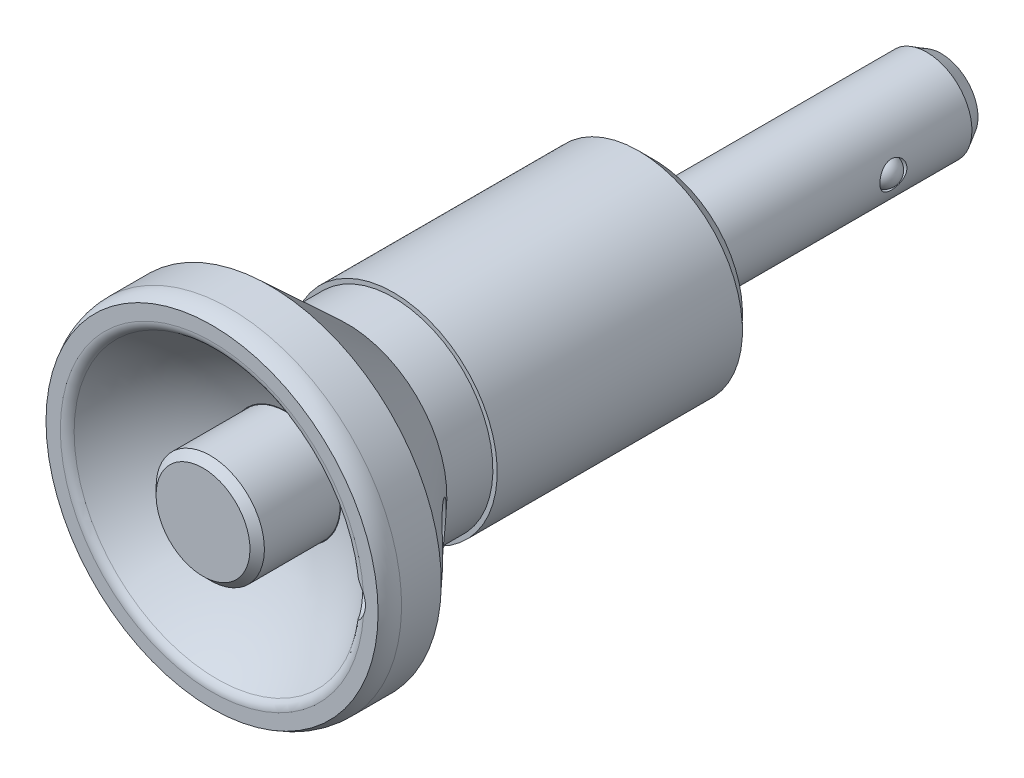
ISO-10303-21;
HEADER;
FILE_DESCRIPTION(('STEP AP214'),'2;1');
FILE_NAME('part.step','',(''),(''),'','','');
FILE_SCHEMA(('AUTOMOTIVE_DESIGN { 1 0 10303 214 1 1 1 1 }'));
ENDSEC;
DATA;
#1=APPLICATION_CONTEXT('core data for automotive mechanical design processes');
#2=APPLICATION_PROTOCOL_DEFINITION('international standard','automotive_design',2000,#1);
#3=PRODUCT_CONTEXT('',#1,'mechanical');
#4=PRODUCT('Part','Part','',(#3));
#5=PRODUCT_RELATED_PRODUCT_CATEGORY('part','',(#4));
#6=PRODUCT_DEFINITION_FORMATION('','',#4);
#7=PRODUCT_DEFINITION_CONTEXT('part definition',#1,'design');
#8=PRODUCT_DEFINITION('design','',#6,#7);
#9=PRODUCT_DEFINITION_SHAPE('','',#8);
#10=(LENGTH_UNIT() NAMED_UNIT(*) SI_UNIT(.MILLI.,.METRE.));
#11=(NAMED_UNIT(*) PLANE_ANGLE_UNIT() SI_UNIT($,.RADIAN.));
#12=(NAMED_UNIT(*) SI_UNIT($,.STERADIAN.) SOLID_ANGLE_UNIT());
#13=UNCERTAINTY_MEASURE_WITH_UNIT(LENGTH_MEASURE(1.E-05),#10,'distance_accuracy_value','');
#14=(GEOMETRIC_REPRESENTATION_CONTEXT(3) GLOBAL_UNCERTAINTY_ASSIGNED_CONTEXT((#13)) GLOBAL_UNIT_ASSIGNED_CONTEXT((#10,
#11,#12)) REPRESENTATION_CONTEXT('',''));
#15=CARTESIAN_POINT('',(0.,0.,0.));
#16=DIRECTION('',(0.,0.,1.));
#17=DIRECTION('',(1.,0.,0.));
#18=AXIS2_PLACEMENT_3D('',#15,#16,#17);
#19=CARTESIAN_POINT('',(0.,0.,-15.9));
#20=DIRECTION('',(0.,0.,-1.));
#21=DIRECTION('',(0.,1.,0.));
#22=AXIS2_PLACEMENT_3D('',#19,#20,#21);
#23=CYLINDRICAL_SURFACE('',#22,1.25);
#24=CARTESIAN_POINT('',(0.,0.,-15.9));
#25=DIRECTION('',(0.,0.,-1.));
#26=DIRECTION('',(0.,1.,0.));
#27=AXIS2_PLACEMENT_3D('',#24,#25,#26);
#28=CIRCLE('',#27,1.25);
#29=CARTESIAN_POINT('',(0.,1.25,-15.9));
#30=VERTEX_POINT('',#29);
#31=EDGE_CURVE('E137',#30,#30,#28,.T.);
#32=ORIENTED_EDGE('',*,*,#31,.T.);
#33=EDGE_LOOP('',(#32));
#34=FACE_BOUND('',#33,.T.);
#35=CARTESIAN_POINT('',(0.,0.,-11.9));
#36=DIRECTION('',(0.,0.,1.));
#37=DIRECTION('',(0.,-1.,0.));
#38=AXIS2_PLACEMENT_3D('',#35,#36,#37);
#39=CIRCLE('',#38,1.25);
#40=CARTESIAN_POINT('',(0.,-1.25,-11.9));
#41=VERTEX_POINT('',#40);
#42=EDGE_CURVE('E73',#41,#41,#39,.T.);
#43=ORIENTED_EDGE('',*,*,#42,.T.);
#44=EDGE_LOOP('',(#43));
#45=FACE_BOUND('',#44,.T.);
#46=ADVANCED_FACE('F14',(#34,#45),#23,.F.);
#47=CARTESIAN_POINT('',(3.5,0.,-10.75));
#48=DIRECTION('',(1.,0.,0.));
#49=DIRECTION('',(0.,1.,0.));
#50=AXIS2_PLACEMENT_3D('',#47,#48,#49);
#51=CYLINDRICAL_SURFACE('',#50,0.75);
#52=CARTESIAN_POINT('',(2.38484800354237,0.75,-10.75));
#53=CARTESIAN_POINT('',(2.38484842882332,0.749999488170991,-10.7910972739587));
#54=CARTESIAN_POINT('',(2.38592195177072,0.746610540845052,-10.8321996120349));
#55=CARTESIAN_POINT('',(2.39008289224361,0.733179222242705,-10.9132026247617));
#56=CARTESIAN_POINT('',(2.39317098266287,0.723134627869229,-10.9531028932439));
#57=CARTESIAN_POINT('',(2.40098051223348,0.696763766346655,-11.0305173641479));
#58=CARTESIAN_POINT('',(2.40569923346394,0.680447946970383,-11.0680354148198));
#59=CARTESIAN_POINT('',(2.41623466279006,0.642032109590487,-11.1398109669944));
#60=CARTESIAN_POINT('',(2.42205153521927,0.619931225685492,-11.1740679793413));
#61=CARTESIAN_POINT('',(2.43433431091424,0.5698237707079,-11.2394331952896));
#62=CARTESIAN_POINT('',(2.44081404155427,0.54166603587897,-11.2704229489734));
#63=CARTESIAN_POINT('',(2.4535743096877,0.480568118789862,-11.327318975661));
#64=CARTESIAN_POINT('',(2.45985482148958,0.447627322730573,-11.3532245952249));
#65=CARTESIAN_POINT('',(2.47166607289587,0.377055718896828,-11.3997313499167));
#66=CARTESIAN_POINT('',(2.47717862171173,0.339342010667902,-11.4202117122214));
#67=CARTESIAN_POINT('',(2.48667217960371,0.26081232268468,-11.4544936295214));
#68=CARTESIAN_POINT('',(2.49065351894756,0.219997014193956,-11.4682966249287));
#69=CARTESIAN_POINT('',(2.49653823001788,0.137661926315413,-11.4884400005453));
#70=CARTESIAN_POINT('',(2.49849778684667,0.0961956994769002,-11.4949825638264));
#71=CARTESIAN_POINT('',(2.50031600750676,0.0127109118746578,-11.5010586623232));
#72=CARTESIAN_POINT('',(2.5001751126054,-0.0293075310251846,-11.500593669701));
#73=CARTESIAN_POINT('',(2.49784801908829,-0.11128557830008,-11.4928035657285));
#74=CARTESIAN_POINT('',(2.49572710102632,-0.151268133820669,-11.4856974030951));
#75=CARTESIAN_POINT('',(2.48975761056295,-0.229444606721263,-11.4651843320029));
#76=CARTESIAN_POINT('',(2.48590892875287,-0.267638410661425,-11.4517770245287));
#77=CARTESIAN_POINT('',(2.47682610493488,-0.341673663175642,-11.4188939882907));
#78=CARTESIAN_POINT('',(2.47157634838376,-0.377482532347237,-11.3993493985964));
#79=CARTESIAN_POINT('',(2.46024820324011,-0.445382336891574,-11.3548010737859));
#80=CARTESIAN_POINT('',(2.45416961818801,-0.477472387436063,-11.3297960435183));
#81=CARTESIAN_POINT('',(2.44155775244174,-0.538330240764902,-11.2739011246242));
#82=CARTESIAN_POINT('',(2.43501597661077,-0.566922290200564,-11.2428215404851));
#83=CARTESIAN_POINT('',(2.42241989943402,-0.618538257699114,-11.176244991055));
#84=CARTESIAN_POINT('',(2.41636564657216,-0.641561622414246,-11.1407475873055));
#85=CARTESIAN_POINT('',(2.40538951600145,-0.681569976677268,-11.0658802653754));
#86=CARTESIAN_POINT('',(2.40047905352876,-0.698494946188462,-11.0264764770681));
#87=CARTESIAN_POINT('',(2.39248196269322,-0.725416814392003,-10.9451963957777));
#88=CARTESIAN_POINT('',(2.38939473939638,-0.73541597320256,-10.9033209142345));
#89=CARTESIAN_POINT('',(2.38552424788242,-0.747873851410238,-10.8199588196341));
#90=CARTESIAN_POINT('',(2.38465939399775,-0.75059973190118,-10.7785158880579));
#91=CARTESIAN_POINT('',(2.38510596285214,-0.749179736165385,-10.6957635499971));
#92=CARTESIAN_POINT('',(2.38641708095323,-0.745034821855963,-10.6544541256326));
#93=CARTESIAN_POINT('',(2.390987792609,-0.730228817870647,-10.5742558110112));
#94=CARTESIAN_POINT('',(2.39419588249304,-0.71973980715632,-10.5353319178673));
#95=CARTESIAN_POINT('',(2.40214570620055,-0.69274288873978,-10.4597991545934));
#96=CARTESIAN_POINT('',(2.40688767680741,-0.676234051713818,-10.42319064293));
#97=CARTESIAN_POINT('',(2.41752917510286,-0.637159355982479,-10.3522412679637));
#98=CARTESIAN_POINT('',(2.42345635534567,-0.61444282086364,-10.317987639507));
#99=CARTESIAN_POINT('',(2.43574102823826,-0.563776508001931,-10.2536809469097));
#100=CARTESIAN_POINT('',(2.44209862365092,-0.535825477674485,-10.2236288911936));
#101=CARTESIAN_POINT('',(2.45481816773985,-0.474227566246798,-10.1674097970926));
#102=CARTESIAN_POINT('',(2.46117122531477,-0.440405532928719,-10.1414321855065));
#103=CARTESIAN_POINT('',(2.4729242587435,-0.368730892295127,-10.0955166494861));
#104=CARTESIAN_POINT('',(2.47832428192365,-0.330878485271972,-10.0755784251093));
#105=CARTESIAN_POINT('',(2.48752985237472,-0.252467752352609,-10.0424999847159));
#106=CARTESIAN_POINT('',(2.49134726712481,-0.211932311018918,-10.0293089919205));
#107=CARTESIAN_POINT('',(2.49700989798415,-0.129084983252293,-10.0099695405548));
#108=CARTESIAN_POINT('',(2.4988556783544,-0.0867736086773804,-10.0038190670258));
#109=CARTESIAN_POINT('',(2.50033272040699,-0.00332607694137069,-9.99888847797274));
#110=CARTESIAN_POINT('',(2.50004652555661,0.0377925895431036,-9.99983365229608));
#111=CARTESIAN_POINT('',(2.49748632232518,0.119259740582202,-10.0084108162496));
#112=CARTESIAN_POINT('',(2.49521242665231,0.159608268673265,-10.0160424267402));
#113=CARTESIAN_POINT('',(2.48895584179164,0.237967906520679,-10.0376058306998));
#114=CARTESIAN_POINT('',(2.48499176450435,0.275999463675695,-10.0514690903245));
#115=CARTESIAN_POINT('',(2.47576471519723,0.349216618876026,-10.0850409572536));
#116=CARTESIAN_POINT('',(2.47050152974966,0.38440174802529,-10.1047505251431));
#117=CARTESIAN_POINT('',(2.45901982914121,0.452150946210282,-10.150186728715));
#118=CARTESIAN_POINT('',(2.45277613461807,0.484595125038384,-10.1760857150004));
#119=CARTESIAN_POINT('',(2.44011768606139,0.544768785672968,-10.2328551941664));
#120=CARTESIAN_POINT('',(2.43370288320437,0.572496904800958,-10.2637271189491));
#121=CARTESIAN_POINT('',(2.42120340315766,0.623281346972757,-10.3306703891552));
#122=CARTESIAN_POINT('',(2.41513426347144,0.646173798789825,-10.3668692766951));
#123=CARTESIAN_POINT('',(2.40426273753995,0.685521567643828,-10.4427775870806));
#124=CARTESIAN_POINT('',(2.3994597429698,0.701979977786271,-10.4824853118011));
#125=CARTESIAN_POINT('',(2.39213908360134,0.726509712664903,-10.5598702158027));
#126=CARTESIAN_POINT('',(2.38943077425,0.735294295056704,-10.5973043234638));
#127=CARTESIAN_POINT('',(2.38578521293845,0.747039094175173,-10.6731576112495));
#128=CARTESIAN_POINT('',(2.38484760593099,0.750000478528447,-10.7115765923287));
#129=CARTESIAN_POINT('',(2.38484800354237,0.75,-10.75));
#130=B_SPLINE_CURVE_WITH_KNOTS('',3,(#52,#53,#54,#55,#56,#57,#58,#59,#60,#61,#62,#63,#64,#65,
#66,#67,#68,#69,#70,#71,#72,#73,#74,#75,#76,#77,#78,#79,#80,#81,#82,#83,#84,#85,#86,#87,#88,#89,
#90,#91,#92,#93,#94,#95,#96,#97,#98,#99,#100,#101,#102,#103,#104,#105,#106,#107,#108,#109,#110,
#111,#112,#113,#114,#115,#116,#117,#118,#119,#120,#121,#122,#123,#124,#125,#126,#127,#128,#129),
.UNSPECIFIED.,.T.,.F.,(4,2,2,2,2,2,2,2,2,2,2,2,2,2,2,2,2,2,2,2,2,2,2,2,2,2,2,2,2,2,2,2,2,2,2,2,
2,2,4),(0.,0.123150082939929,0.246341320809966,0.369328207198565,0.492333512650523,
0.618865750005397,0.745414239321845,0.874579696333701,1.00371727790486,1.12916070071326,
1.25457777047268,1.37600062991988,1.49743117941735,1.62027604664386,1.74315008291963,
1.87076073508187,1.9983840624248,2.12723119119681,2.25603625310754,2.38004040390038,
2.50402719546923,2.62479297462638,2.74557740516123,2.86960365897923,2.9936596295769,
3.1223975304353,3.2511290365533,3.37887695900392,3.5065883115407,3.62938151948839,
3.75216776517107,3.87363548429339,3.99512317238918,4.12049813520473,4.24590926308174,
4.37505819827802,4.50414496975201,4.61930576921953,4.7344434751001),.UNSPECIFIED.);
#131=CARTESIAN_POINT('',(2.38484800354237,0.75,-10.75));
#132=VERTEX_POINT('',#131);
#133=EDGE_CURVE('E467',#132,#132,#130,.T.);
#134=ORIENTED_EDGE('',*,*,#133,.F.);
#135=EDGE_LOOP('',(#134));
#136=FACE_BOUND('',#135,.T.);
#137=CARTESIAN_POINT('',(2.12206555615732,0.,-11.5));
#138=CARTESIAN_POINT('',(2.122065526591,0.0420016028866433,-11.4999980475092));
#139=CARTESIAN_POINT('',(2.12177655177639,0.0840371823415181,-11.4964593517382));
#140=CARTESIAN_POINT('',(2.12061587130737,0.166953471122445,-11.4823928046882));
#141=CARTESIAN_POINT('',(2.11974338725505,0.207832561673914,-11.4718556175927));
#142=CARTESIAN_POINT('',(2.11740251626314,0.28721580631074,-11.444098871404));
#143=CARTESIAN_POINT('',(2.11593446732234,0.325721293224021,-11.4268831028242));
#144=CARTESIAN_POINT('',(2.11237724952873,0.399276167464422,-11.3862728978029));
#145=CARTESIAN_POINT('',(2.11028825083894,0.434326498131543,-11.3628801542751));
#146=CARTESIAN_POINT('',(2.10543833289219,0.500027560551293,-11.3105688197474));
#147=CARTESIAN_POINT('',(2.10267678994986,0.530674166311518,-11.2816451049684));
#148=CARTESIAN_POINT('',(2.09639815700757,0.586669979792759,-11.219125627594));
#149=CARTESIAN_POINT('',(2.092881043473,0.612019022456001,-11.1855297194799));
#150=CARTESIAN_POINT('',(2.08489768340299,0.65675554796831,-11.1146022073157));
#151=CARTESIAN_POINT('',(2.0804297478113,0.676132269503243,-11.0772640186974));
#152=CARTESIAN_POINT('',(2.07020296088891,0.708344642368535,-10.999991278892));
#153=CARTESIAN_POINT('',(2.0644438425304,0.721178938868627,-10.9600561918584));
#154=CARTESIAN_POINT('',(2.05389778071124,0.735194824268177,-10.8996910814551));
#155=CARTESIAN_POINT('',(2.05010571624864,0.73898319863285,-10.8796691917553));
#156=CARTESIAN_POINT('',(2.04141297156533,0.74488576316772,-10.8397229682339));
#157=CARTESIAN_POINT('',(2.03651754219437,0.747007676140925,-10.8197986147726));
#158=CARTESIAN_POINT('',(2.02684555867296,0.748972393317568,-10.790414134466));
#159=CARTESIAN_POINT('',(2.02323558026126,0.749424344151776,-10.7807072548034));
#160=CARTESIAN_POINT('',(2.01701848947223,0.74975233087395,-10.7694169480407));
#161=CARTESIAN_POINT('',(2.01567493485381,0.749806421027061,-10.767179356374));
#162=CARTESIAN_POINT('',(2.01268052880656,0.749891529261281,-10.7629215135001));
#163=CARTESIAN_POINT('',(2.01103259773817,0.749922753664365,-10.7608994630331));
#164=CARTESIAN_POINT('',(2.0084776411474,0.74995123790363,-10.758574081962));
#165=CARTESIAN_POINT('',(2.00780452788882,0.74995728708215,-10.7580205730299));
#166=CARTESIAN_POINT('',(2.00638639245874,0.749967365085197,-10.7570139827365));
#167=CARTESIAN_POINT('',(2.00564151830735,0.749971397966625,-10.7565607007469));
#168=CARTESIAN_POINT('',(2.00429958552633,0.74997677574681,-10.7559086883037));
#169=CARTESIAN_POINT('',(2.00372014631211,0.749978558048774,-10.7556742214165));
#170=CARTESIAN_POINT('',(2.00253072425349,0.74998127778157,-10.7553026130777));
#171=CARTESIAN_POINT('',(2.00192078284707,0.749982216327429,-10.7551653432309));
#172=CARTESIAN_POINT('',(2.00068118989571,0.749983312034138,-10.7550039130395));
#173=CARTESIAN_POINT('',(2.0000514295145,0.749983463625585,-10.754980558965));
#174=CARTESIAN_POINT('',(1.99879872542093,0.749982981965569,-10.7550524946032));
#175=CARTESIAN_POINT('',(1.99817578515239,0.749982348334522,-10.7551478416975));
#176=CARTESIAN_POINT('',(1.99687877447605,0.74998011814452,-10.7554634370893));
#177=CARTESIAN_POINT('',(1.99620827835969,0.749978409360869,-10.7556980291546));
#178=CARTESIAN_POINT('',(1.99491412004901,0.749973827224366,-10.7562722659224));
#179=CARTESIAN_POINT('',(1.99429055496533,0.749970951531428,-10.7566121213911));
#180=CARTESIAN_POINT('',(1.99269674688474,0.749961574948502,-10.757617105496));
#181=CARTESIAN_POINT('',(1.99176918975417,0.749953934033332,-10.7583489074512));
#182=CARTESIAN_POINT('',(1.99002713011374,0.749934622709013,-10.759935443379));
#183=CARTESIAN_POINT('',(1.98921298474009,0.74992293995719,-10.7607905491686));
#184=CARTESIAN_POINT('',(1.98611387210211,0.749867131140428,-10.7643633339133));
#185=CARTESIAN_POINT('',(1.98416699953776,0.749805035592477,-10.767365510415));
#186=CARTESIAN_POINT('',(1.98064972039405,0.749635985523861,-10.7735811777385));
#187=CARTESIAN_POINT('',(1.97908220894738,0.749528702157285,-10.7767960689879));
#188=CARTESIAN_POINT('',(1.97118573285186,0.748823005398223,-10.7943323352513));
#189=CARTESIAN_POINT('',(1.96669087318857,0.74779102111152,-10.8094291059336));
#190=CARTESIAN_POINT('',(1.9587074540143,0.744776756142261,-10.8397066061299));
#191=CARTESIAN_POINT('',(1.95522081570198,0.742792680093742,-10.8548874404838));
#192=CARTESIAN_POINT('',(1.94374396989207,0.733930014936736,-10.9094467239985));
#193=CARTESIAN_POINT('',(1.93743955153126,0.724291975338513,-10.9488040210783));
#194=CARTESIAN_POINT('',(1.92627183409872,0.698725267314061,-11.0255607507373));
#195=CARTESIAN_POINT('',(1.92140902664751,0.68279445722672,-11.0629595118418));
#196=CARTESIAN_POINT('',(1.91269378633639,0.644884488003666,-11.1350867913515));
#197=CARTESIAN_POINT('',(1.90884957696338,0.622858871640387,-11.169792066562));
#198=CARTESIAN_POINT('',(1.90194437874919,0.573395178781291,-11.2351809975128));
#199=CARTESIAN_POINT('',(1.89888335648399,0.545957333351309,-11.2658648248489));
#200=CARTESIAN_POINT('',(1.89337289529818,0.485652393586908,-11.3230715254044));
#201=CARTESIAN_POINT('',(1.8909406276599,0.452666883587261,-11.3494714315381));
#202=CARTESIAN_POINT('',(1.88672141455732,0.382705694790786,-11.3963827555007));
#203=CARTESIAN_POINT('',(1.88493451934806,0.345729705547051,-11.4168937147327));
#204=CARTESIAN_POINT('',(1.88197364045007,0.268898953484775,-11.4514014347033));
#205=CARTESIAN_POINT('',(1.880798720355,0.229048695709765,-11.4654081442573));
#206=CARTESIAN_POINT('',(1.87903847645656,0.147552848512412,-11.4865461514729));
#207=CARTESIAN_POINT('',(1.87845313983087,0.105907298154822,-11.4936775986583));
#208=CARTESIAN_POINT('',(1.87786418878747,0.0220644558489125,-11.5008535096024));
#209=CARTESIAN_POINT('',(1.87785976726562,-0.0201319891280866,-11.5009078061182));
#210=CARTESIAN_POINT('',(1.8784305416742,-0.103934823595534,-11.4939525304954));
#211=CARTESIAN_POINT('',(1.87900573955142,-0.145541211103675,-11.4869429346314));
#212=CARTESIAN_POINT('',(1.88074362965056,-0.226969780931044,-11.4660662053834));
#213=CARTESIAN_POINT('',(1.88190614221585,-0.266792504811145,-11.4522011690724));
#214=CARTESIAN_POINT('',(1.88483707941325,-0.343537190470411,-11.4180169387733));
#215=CARTESIAN_POINT('',(1.88660547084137,-0.380459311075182,-11.3976980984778));
#216=CARTESIAN_POINT('',(1.89078474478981,-0.450386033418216,-11.3511798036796));
#217=CARTESIAN_POINT('',(1.89319605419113,-0.483388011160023,-11.3249764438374));
#218=CARTESIAN_POINT('',(1.89872480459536,-0.544528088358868,-11.2674467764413));
#219=CARTESIAN_POINT('',(1.90184247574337,-0.572664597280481,-11.2361188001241));
#220=CARTESIAN_POINT('',(1.90891559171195,-0.62333242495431,-11.1691939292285));
#221=CARTESIAN_POINT('',(1.91287294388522,-0.645850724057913,-11.1335873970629));
#222=CARTESIAN_POINT('',(1.92185974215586,-0.68455657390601,-11.059244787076));
#223=CARTESIAN_POINT('',(1.92688769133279,-0.700752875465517,-11.0205131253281));
#224=CARTESIAN_POINT('',(1.93569998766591,-0.71991205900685,-10.9613088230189));
#225=CARTESIAN_POINT('',(1.93882374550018,-0.725422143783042,-10.9415275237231));
#226=CARTESIAN_POINT('',(1.94572571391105,-0.734783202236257,-10.9016930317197));
#227=CARTESIAN_POINT('',(1.94950340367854,-0.738635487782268,-10.8816400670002));
#228=CARTESIAN_POINT('',(1.9581456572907,-0.744662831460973,-10.8415775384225));
#229=CARTESIAN_POINT('',(1.96300736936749,-0.746842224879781,-10.8215679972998));
#230=CARTESIAN_POINT('',(1.97256849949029,-0.748884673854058,-10.7920280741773));
#231=CARTESIAN_POINT('',(1.97613548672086,-0.749360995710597,-10.7822567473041));
#232=CARTESIAN_POINT('',(1.98218536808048,-0.749715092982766,-10.7708069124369));
#233=CARTESIAN_POINT('',(1.98348487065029,-0.749774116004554,-10.7685398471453));
#234=CARTESIAN_POINT('',(1.98636386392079,-0.74986881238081,-10.7641876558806));
#235=CARTESIAN_POINT('',(1.98794184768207,-0.749904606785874,-10.7621016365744));
#236=CARTESIAN_POINT('',(1.9904776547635,-0.749940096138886,-10.759509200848));
#237=CARTESIAN_POINT('',(1.99123387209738,-0.749948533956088,-10.7588100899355));
#238=CARTESIAN_POINT('',(1.99284087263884,-0.749962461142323,-10.7575302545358));
#239=CARTESIAN_POINT('',(1.99369132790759,-0.74996796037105,-10.7569491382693));
#240=CARTESIAN_POINT('',(1.99514970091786,-0.749974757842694,-10.7561608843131));
#241=CARTESIAN_POINT('',(1.99572587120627,-0.749976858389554,-10.7558957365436));
#242=CARTESIAN_POINT('',(1.99691288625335,-0.749980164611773,-10.7554589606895));
#243=CARTESIAN_POINT('',(1.99752368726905,-0.74998137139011,-10.7552872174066));
#244=CARTESIAN_POINT('',(1.99877257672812,-0.749982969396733,-10.755055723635));
#245=CARTESIAN_POINT('',(1.99941086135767,-0.749983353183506,-10.7549969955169));
#246=CARTESIAN_POINT('',(2.00068685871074,-0.749983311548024,-10.7550032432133));
#247=CARTESIAN_POINT('',(2.0013245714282,-0.749982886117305,-10.7550682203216));
#248=CARTESIAN_POINT('',(2.00250998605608,-0.749981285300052,-10.7552992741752));
#249=CARTESIAN_POINT('',(2.00306003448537,-0.749980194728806,-10.7554538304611));
#250=CARTESIAN_POINT('',(2.00413225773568,-0.749977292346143,-10.7558393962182));
#251=CARTESIAN_POINT('',(2.00465441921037,-0.749975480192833,-10.7560704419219));
#252=CARTESIAN_POINT('',(2.00604384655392,-0.749969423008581,-10.7567872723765));
#253=CARTESIAN_POINT('',(2.00687904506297,-0.749964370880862,-10.7573347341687));
#254=CARTESIAN_POINT('',(2.00845949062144,-0.749951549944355,-10.7585470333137));
#255=CARTESIAN_POINT('',(2.00920439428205,-0.749943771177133,-10.7592122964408));
#256=CARTESIAN_POINT('',(2.01179340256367,-0.749909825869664,-10.7617738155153));
#257=CARTESIAN_POINT('',(2.01341810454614,-0.74987452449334,-10.7638864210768));
#258=CARTESIAN_POINT('',(2.01637599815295,-0.749779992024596,-10.7683057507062));
#259=CARTESIAN_POINT('',(2.01770709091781,-0.749720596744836,-10.7706137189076));
#260=CARTESIAN_POINT('',(2.0238618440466,-0.749364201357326,-10.782208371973));
#261=CARTESIAN_POINT('',(2.02747600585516,-0.748881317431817,-10.7921055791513));
#262=CARTESIAN_POINT('',(2.03390293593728,-0.747496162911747,-10.812079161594));
#263=CARTESIAN_POINT('',(2.03671325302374,-0.746592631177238,-10.8221559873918));
#264=CARTESIAN_POINT('',(2.0485475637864,-0.741498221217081,-10.8682211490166));
#265=CARTESIAN_POINT('',(2.05509857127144,-0.734806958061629,-10.9046218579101));
#266=CARTESIAN_POINT('',(2.06668346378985,-0.716059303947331,-10.9761498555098));
#267=CARTESIAN_POINT('',(2.07171700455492,-0.704001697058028,-11.0112768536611));
#268=CARTESIAN_POINT('',(2.08068762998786,-0.674801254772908,-11.0794028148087));
#269=CARTESIAN_POINT('',(2.08462795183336,-0.657673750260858,-11.1124078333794));
#270=CARTESIAN_POINT('',(2.09177764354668,-0.618687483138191,-11.1755655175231));
#271=CARTESIAN_POINT('',(2.09498703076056,-0.596828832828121,-11.2057182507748));
#272=CARTESIAN_POINT('',(2.10116735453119,-0.545719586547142,-11.2661901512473));
#273=CARTESIAN_POINT('',(2.1040530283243,-0.51587740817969,-11.2960211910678));
#274=CARTESIAN_POINT('',(2.10914374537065,-0.451566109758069,-11.3503003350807));
#275=CARTESIAN_POINT('',(2.11134835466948,-0.417094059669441,-11.374745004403));
#276=CARTESIAN_POINT('',(2.11512569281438,-0.344521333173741,-11.4175173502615));
#277=CARTESIAN_POINT('',(2.11669850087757,-0.306421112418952,-11.4358457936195));
#278=CARTESIAN_POINT('',(2.11924053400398,-0.227705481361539,-11.4658349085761));
#279=CARTESIAN_POINT('',(2.12021060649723,-0.187093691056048,-11.477504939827));
#280=CARTESIAN_POINT('',(2.12128084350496,-0.121823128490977,-11.4904453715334));
#281=CARTESIAN_POINT('',(2.12157516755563,-0.0976020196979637,-11.494024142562));
#282=CARTESIAN_POINT('',(2.12196753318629,-0.0489244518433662,-11.4988020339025));
#283=CARTESIAN_POINT('',(2.12206557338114,-0.0244679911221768,-11.5000011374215));
#284=CARTESIAN_POINT('',(2.12206555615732,0.,-11.5));
#285=B_SPLINE_CURVE_WITH_KNOTS('',3,(#137,#138,#139,#140,#141,#142,#143,#144,#145,#146,#147,
#148,#149,#150,#151,#152,#153,#154,#155,#156,#157,#158,#159,#160,#161,#162,#163,#164,#165,#166,
#167,#168,#169,#170,#171,#172,#173,#174,#175,#176,#177,#178,#179,#180,#181,#182,#183,#184,#185,
#186,#187,#188,#189,#190,#191,#192,#193,#194,#195,#196,#197,#198,#199,#200,#201,#202,#203,#204,
#205,#206,#207,#208,#209,#210,#211,#212,#213,#214,#215,#216,#217,#218,#219,#220,#221,#222,#223,
#224,#225,#226,#227,#228,#229,#230,#231,#232,#233,#234,#235,#236,#237,#238,#239,#240,#241,#242,
#243,#244,#245,#246,#247,#248,#249,#250,#251,#252,#253,#254,#255,#256,#257,#258,#259,#260,#261,
#262,#263,#264,#265,#266,#267,#268,#269,#270,#271,#272,#273,#274,#275,#276,#277,#278,#279,#280,
#281,#282,#283,#284),.UNSPECIFIED.,.T.,.F.,(4,2,2,2,2,2,2,2,2,2,2,2,2,2,2,2,2,2,2,2,2,2,2,2,2,2,
2,2,2,2,2,2,2,2,2,2,2,2,2,2,2,2,2,2,2,2,2,2,2,2,2,2,2,2,2,2,2,2,2,2,2,2,2,2,2,2,2,2,2,2,2,2,2,
4),(0.,0.125915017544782,0.251998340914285,0.37801020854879,0.503987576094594,0.630082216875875,
0.756180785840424,0.882505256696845,1.00885587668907,1.07095509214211,1.13276479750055,
1.16364176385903,1.17146560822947,1.17921795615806,1.18182645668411,1.18442968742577,
1.18629815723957,1.18816415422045,1.19004333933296,1.19192343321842,1.19404265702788,
1.19616615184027,1.19969056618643,1.20322583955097,1.21387723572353,1.22460752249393,
1.27164281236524,1.31876714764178,1.4410468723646,1.56336824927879,1.68664899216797,
1.80992447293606,1.93627677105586,2.06263890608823,2.18880711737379,2.31497258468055,
2.44096276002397,2.56695335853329,2.69290544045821,2.81885062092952,2.94487963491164,
3.07094977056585,3.19730940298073,3.32349350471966,3.38574594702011,3.44794903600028,
3.5099903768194,3.54103548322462,3.54886944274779,3.55666224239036,3.55974510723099,
3.56281756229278,3.56471411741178,3.5666083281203,3.56851959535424,3.57043088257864,
3.5721383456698,3.57384661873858,3.57682501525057,3.57981440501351,3.58774744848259,
3.59573548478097,3.62715703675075,3.65867340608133,3.77072612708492,3.88280425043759,
3.99454686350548,4.10628682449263,4.23255563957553,4.35890474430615,4.48523800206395,
4.61139323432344,4.68474438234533,4.75809604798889),.UNSPECIFIED.);
#286=CARTESIAN_POINT('',(1.98517452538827,-0.749829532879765,-10.7659897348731));
#287=VERTEX_POINT('',#286);
#288=CARTESIAN_POINT('',(1.98517452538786,0.749829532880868,-10.7659897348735));
#289=VERTEX_POINT('',#288);
#290=EDGE_CURVE('E32',#287,#289,#285,.T.);
#291=ORIENTED_EDGE('',*,*,#290,.F.);
#292=CARTESIAN_POINT('',(1.98511012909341,0.75,-10.75));
#293=CARTESIAN_POINT('',(1.98510947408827,0.750000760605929,-10.7906891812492));
#294=CARTESIAN_POINT('',(1.98637478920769,0.746677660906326,-10.8313730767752));
#295=CARTESIAN_POINT('',(1.99126881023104,0.733525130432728,-10.9115254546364));
#296=CARTESIAN_POINT('',(1.99489767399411,0.723695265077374,-10.9509938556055));
#297=CARTESIAN_POINT('',(2.00405749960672,0.697925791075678,-11.027538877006));
#298=CARTESIAN_POINT('',(2.00958434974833,0.681999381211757,-11.0646204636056));
#299=CARTESIAN_POINT('',(2.02191113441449,0.644534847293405,-11.1355987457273));
#300=CARTESIAN_POINT('',(2.02871140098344,0.622995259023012,-11.1694946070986));
#301=CARTESIAN_POINT('',(2.04315464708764,0.573899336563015,-11.2346325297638));
#302=CARTESIAN_POINT('',(2.05082046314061,0.546136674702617,-11.2657140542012));
#303=CARTESIAN_POINT('',(2.06593925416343,0.485821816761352,-11.3228913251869));
#304=CARTESIAN_POINT('',(2.07339218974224,0.453268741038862,-11.3489861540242));
#305=CARTESIAN_POINT('',(2.08751316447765,0.383102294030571,-11.396198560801));
#306=CARTESIAN_POINT('',(2.09415125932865,0.345367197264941,-11.4171449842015));
#307=CARTESIAN_POINT('',(2.10562302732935,0.26663349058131,-11.4523276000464));
#308=CARTESIAN_POINT('',(2.11045725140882,0.225635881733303,-11.4665658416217));
#309=CARTESIAN_POINT('',(2.11761468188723,0.143226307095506,-11.4873748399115));
#310=CARTESIAN_POINT('',(2.12002790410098,0.101891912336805,-11.4942212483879));
#311=CARTESIAN_POINT('',(2.12239260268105,0.0185951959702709,-11.5009318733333));
#312=CARTESIAN_POINT('',(2.12234479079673,-0.0233669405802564,-11.5007981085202));
#313=CARTESIAN_POINT('',(2.1198520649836,-0.104765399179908,-11.4937203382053));
#314=CARTESIAN_POINT('',(2.11751277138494,-0.144231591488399,-11.4870763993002));
#315=CARTESIAN_POINT('',(2.11083531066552,-0.221447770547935,-11.4676670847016));
#316=CARTESIAN_POINT('',(2.10649700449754,-0.259197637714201,-11.4549012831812));
#317=CARTESIAN_POINT('',(2.09618170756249,-0.332529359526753,-11.4234526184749));
#318=CARTESIAN_POINT('',(2.09018277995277,-0.368073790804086,-11.4046899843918));
#319=CARTESIAN_POINT('',(2.07716261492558,-0.435593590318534,-11.3618481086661));
#320=CARTESIAN_POINT('',(2.07014107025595,-0.467567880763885,-11.3377672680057));
#321=CARTESIAN_POINT('',(2.05537310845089,-0.528817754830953,-11.2834909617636));
#322=CARTESIAN_POINT('',(2.04760798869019,-0.557863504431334,-11.2530408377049));
#323=CARTESIAN_POINT('',(2.03253136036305,-0.610516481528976,-11.187644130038));
#324=CARTESIAN_POINT('',(2.02521994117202,-0.634122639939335,-11.1526966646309));
#325=CARTESIAN_POINT('',(2.01176867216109,-0.675599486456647,-11.0784862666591));
#326=CARTESIAN_POINT('',(2.00565194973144,-0.69336080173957,-11.039157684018));
#327=CARTESIAN_POINT('',(1.99554932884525,-0.721926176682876,-10.9577958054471));
#328=CARTESIAN_POINT('',(1.99156240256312,-0.732733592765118,-10.9157638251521));
#329=CARTESIAN_POINT('',(1.98640793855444,-0.746590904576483,-10.8324370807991));
#330=CARTESIAN_POINT('',(1.98510948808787,-0.750001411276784,-10.7912104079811));
#331=CARTESIAN_POINT('',(1.98511077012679,-0.749998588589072,-10.7087622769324));
#332=CARTESIAN_POINT('',(1.98640995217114,-0.746586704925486,-10.6675408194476));
#333=CARTESIAN_POINT('',(1.99132841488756,-0.73336148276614,-10.5880087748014));
#334=CARTESIAN_POINT('',(1.99485212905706,-0.723811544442,-10.5496478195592));
#335=CARTESIAN_POINT('',(2.00371360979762,-0.698904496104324,-10.4750848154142));
#336=CARTESIAN_POINT('',(2.00905172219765,-0.683546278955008,-10.4388831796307));
#337=CARTESIAN_POINT('',(2.02116838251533,-0.6468578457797,-10.3682772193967));
#338=CARTESIAN_POINT('',(2.02799034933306,-0.625339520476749,-10.3339783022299));
#339=CARTESIAN_POINT('',(2.04222723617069,-0.577148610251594,-10.2693487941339));
#340=CARTESIAN_POINT('',(2.049642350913,-0.550474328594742,-10.2390195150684));
#341=CARTESIAN_POINT('',(2.06472450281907,-0.490984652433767,-10.1814583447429));
#342=CARTESIAN_POINT('',(2.07238288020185,-0.457911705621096,-10.1544895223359));
#343=CARTESIAN_POINT('',(2.08669071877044,-0.387520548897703,-10.1064607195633));
#344=CARTESIAN_POINT('',(2.09334020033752,-0.350202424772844,-10.085400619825));
#345=CARTESIAN_POINT('',(2.10486052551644,-0.272501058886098,-10.04996007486));
#346=CARTESIAN_POINT('',(2.10974080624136,-0.232135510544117,-10.0355440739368));
#347=CARTESIAN_POINT('',(2.11721112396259,-0.149343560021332,-10.0137754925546));
#348=CARTESIAN_POINT('',(2.11980210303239,-0.106918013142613,-10.0064200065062));
#349=CARTESIAN_POINT('',(2.1223221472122,-0.0236025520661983,-9.99926765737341));
#350=CARTESIAN_POINT('',(2.12238350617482,0.0172514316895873,-9.99909513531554));
#351=CARTESIAN_POINT('',(2.12017213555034,0.0983795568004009,-10.0053683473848));
#352=CARTESIAN_POINT('',(2.11789963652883,0.138653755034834,-10.0118134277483));
#353=CARTESIAN_POINT('',(2.11133034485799,0.21668156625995,-10.0308817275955));
#354=CARTESIAN_POINT('',(2.10707427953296,0.254469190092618,-10.0433808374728));
#355=CARTESIAN_POINT('',(2.09697770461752,0.327420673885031,-10.0740837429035));
#356=CARTESIAN_POINT('',(2.09113689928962,0.362584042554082,-10.0922886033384));
#357=CARTESIAN_POINT('',(2.07817677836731,0.430810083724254,-10.1347117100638));
#358=CARTESIAN_POINT('',(2.07101599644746,0.463734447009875,-10.1591395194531));
#359=CARTESIAN_POINT('',(2.05630552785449,0.525136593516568,-10.2129712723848));
#360=CARTESIAN_POINT('',(2.04875571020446,0.553612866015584,-10.2423768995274));
#361=CARTESIAN_POINT('',(2.03370376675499,0.606635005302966,-10.3069242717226));
#362=CARTESIAN_POINT('',(2.02621942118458,0.630943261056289,-10.3422660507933));
#363=CARTESIAN_POINT('',(2.01255226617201,0.673269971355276,-10.4167698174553));
#364=CARTESIAN_POINT('',(2.00636932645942,0.691289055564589,-10.4559314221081));
#365=CARTESIAN_POINT('',(1.996117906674,0.720357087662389,-10.5368652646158));
#366=CARTESIAN_POINT('',(1.9920414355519,0.731432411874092,-10.5786269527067));
#367=CARTESIAN_POINT('',(1.9865385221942,0.746251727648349,-10.6635948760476));
#368=CARTESIAN_POINT('',(1.98511082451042,0.749999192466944,-10.706800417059));
#369=CARTESIAN_POINT('',(1.98511012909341,0.75,-10.75));
#370=B_SPLINE_CURVE_WITH_KNOTS('',3,(#292,#293,#294,#295,#296,#297,#298,#299,#300,#301,#302,
#303,#304,#305,#306,#307,#308,#309,#310,#311,#312,#313,#314,#315,#316,#317,#318,#319,#320,#321,
#322,#323,#324,#325,#326,#327,#328,#329,#330,#331,#332,#333,#334,#335,#336,#337,#338,#339,#340,
#341,#342,#343,#344,#345,#346,#347,#348,#349,#350,#351,#352,#353,#354,#355,#356,#357,#358,#359,
#360,#361,#362,#363,#364,#365,#366,#367,#368,#369),.UNSPECIFIED.,.T.,.F.,(4,2,2,2,2,2,2,2,2,2,2,
2,2,2,2,2,2,2,2,2,2,2,2,2,2,2,2,2,2,2,2,2,2,2,2,2,2,2,4),(0.,0.121907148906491,
0.243822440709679,0.365475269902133,0.487159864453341,0.613715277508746,0.740293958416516,
0.870638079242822,1.00094235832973,1.1261990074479,1.25141943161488,1.37112727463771,
1.49084344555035,1.61222346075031,1.73364002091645,1.86143140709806,1.98924788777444,
2.11933565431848,2.24936058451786,2.37288906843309,2.49639137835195,2.61491875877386,
2.73346874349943,2.85611728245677,2.97880625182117,3.10826153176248,3.23771419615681,
3.36646581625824,3.49516442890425,3.61712333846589,3.73907020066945,3.85861662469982,
3.97818537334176,4.10248855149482,4.22683385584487,4.35683352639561,4.48682017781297,
4.61631002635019,4.7457384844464),.UNSPECIFIED.);
#371=EDGE_CURVE('E68',#287,#289,#370,.T.);
#372=ORIENTED_EDGE('',*,*,#371,.T.);
#373=EDGE_LOOP('',(#291,#372));
#374=FACE_BOUND('',#373,.T.);
#375=ADVANCED_FACE('F72',(#136,#374),#51,.F.);
#376=CARTESIAN_POINT('',(-2.38484800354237,0.75,-10.75));
#377=CARTESIAN_POINT('',(-2.38484842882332,0.74999948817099,-10.7089027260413));
#378=CARTESIAN_POINT('',(-2.38592195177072,0.74661054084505,-10.6678003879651));
#379=CARTESIAN_POINT('',(-2.39008289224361,0.733179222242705,-10.5867973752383));
#380=CARTESIAN_POINT('',(-2.39317098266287,0.723134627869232,-10.5468971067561));
#381=CARTESIAN_POINT('',(-2.40098051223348,0.696763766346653,-10.4694826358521));
#382=CARTESIAN_POINT('',(-2.40569923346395,0.680447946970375,-10.4319645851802));
#383=CARTESIAN_POINT('',(-2.41623466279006,0.642032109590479,-10.3601890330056));
#384=CARTESIAN_POINT('',(-2.42205153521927,0.619931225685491,-10.3259320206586));
#385=CARTESIAN_POINT('',(-2.43433431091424,0.569823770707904,-10.2605668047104));
#386=CARTESIAN_POINT('',(-2.44081404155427,0.541666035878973,-10.2295770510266));
#387=CARTESIAN_POINT('',(-2.4535743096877,0.480568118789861,-10.172681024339));
#388=CARTESIAN_POINT('',(-2.45985482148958,0.447627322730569,-10.1467754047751));
#389=CARTESIAN_POINT('',(-2.47166607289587,0.377055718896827,-10.1002686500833));
#390=CARTESIAN_POINT('',(-2.47717862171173,0.339342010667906,-10.0797882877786));
#391=CARTESIAN_POINT('',(-2.48667217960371,0.260812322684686,-10.0455063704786));
#392=CARTESIAN_POINT('',(-2.49065351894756,0.219997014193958,-10.0317033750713));
#393=CARTESIAN_POINT('',(-2.49653823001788,0.137661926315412,-10.0115599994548));
#394=CARTESIAN_POINT('',(-2.49849778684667,0.0961956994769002,-10.0050174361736));
#395=CARTESIAN_POINT('',(-2.50031600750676,0.0127109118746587,-9.99894133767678));
#396=CARTESIAN_POINT('',(-2.5001751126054,-0.0293075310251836,-9.99940633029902));
#397=CARTESIAN_POINT('',(-2.49784801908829,-0.111285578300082,-10.0071964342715));
#398=CARTESIAN_POINT('',(-2.49572710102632,-0.151268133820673,-10.0143025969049));
#399=CARTESIAN_POINT('',(-2.48975761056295,-0.229444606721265,-10.0348156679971));
#400=CARTESIAN_POINT('',(-2.48590892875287,-0.267638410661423,-10.0482229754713));
#401=CARTESIAN_POINT('',(-2.47682610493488,-0.341673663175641,-10.0811060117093));
#402=CARTESIAN_POINT('',(-2.47157634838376,-0.377482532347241,-10.1006506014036));
#403=CARTESIAN_POINT('',(-2.46024820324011,-0.44538233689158,-10.1451989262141));
#404=CARTESIAN_POINT('',(-2.45416961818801,-0.477472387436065,-10.1702039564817));
#405=CARTESIAN_POINT('',(-2.44155775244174,-0.538330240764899,-10.2260988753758));
#406=CARTESIAN_POINT('',(-2.43501597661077,-0.566922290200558,-10.2571784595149));
#407=CARTESIAN_POINT('',(-2.42241989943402,-0.618538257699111,-10.323755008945));
#408=CARTESIAN_POINT('',(-2.41636564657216,-0.641561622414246,-10.3592524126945));
#409=CARTESIAN_POINT('',(-2.40538951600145,-0.68156997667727,-10.4341197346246));
#410=CARTESIAN_POINT('',(-2.40047905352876,-0.698494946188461,-10.4735235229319));
#411=CARTESIAN_POINT('',(-2.39248196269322,-0.725416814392,-10.5548036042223));
#412=CARTESIAN_POINT('',(-2.38939473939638,-0.735415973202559,-10.5966790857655));
#413=CARTESIAN_POINT('',(-2.38552424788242,-0.747873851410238,-10.6800411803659));
#414=CARTESIAN_POINT('',(-2.38465939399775,-0.75059973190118,-10.7214841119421));
#415=CARTESIAN_POINT('',(-2.38510596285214,-0.749179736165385,-10.8042364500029));
#416=CARTESIAN_POINT('',(-2.38641708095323,-0.745034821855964,-10.8455458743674));
#417=CARTESIAN_POINT('',(-2.390987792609,-0.730228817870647,-10.9257441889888));
#418=CARTESIAN_POINT('',(-2.39419588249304,-0.719739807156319,-10.9646680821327));
#419=CARTESIAN_POINT('',(-2.40214570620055,-0.69274288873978,-11.0402008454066));
#420=CARTESIAN_POINT('',(-2.40688767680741,-0.676234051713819,-11.07680935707));
#421=CARTESIAN_POINT('',(-2.41752917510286,-0.637159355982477,-11.1477587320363));
#422=CARTESIAN_POINT('',(-2.42345635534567,-0.614442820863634,-11.182012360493));
#423=CARTESIAN_POINT('',(-2.43574102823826,-0.563776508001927,-11.2463190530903));
#424=CARTESIAN_POINT('',(-2.44209862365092,-0.535825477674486,-11.2763711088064));
#425=CARTESIAN_POINT('',(-2.45481816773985,-0.4742275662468,-11.3325902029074));
#426=CARTESIAN_POINT('',(-2.46117122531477,-0.440405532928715,-11.3585678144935));
#427=CARTESIAN_POINT('',(-2.4729242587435,-0.368730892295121,-11.4044833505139));
#428=CARTESIAN_POINT('',(-2.47832428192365,-0.33087848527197,-11.4244215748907));
#429=CARTESIAN_POINT('',(-2.48752985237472,-0.252467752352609,-11.4575000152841));
#430=CARTESIAN_POINT('',(-2.49134726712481,-0.211932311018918,-11.4706910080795));
#431=CARTESIAN_POINT('',(-2.49700989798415,-0.129084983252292,-11.4900304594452));
#432=CARTESIAN_POINT('',(-2.4988556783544,-0.08677360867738,-11.4961809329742));
#433=CARTESIAN_POINT('',(-2.50033272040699,-0.00332607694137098,-11.5011115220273));
#434=CARTESIAN_POINT('',(-2.50004652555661,0.0377925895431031,-11.5001663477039));
#435=CARTESIAN_POINT('',(-2.49748632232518,0.119259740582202,-11.4915891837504));
#436=CARTESIAN_POINT('',(-2.49521242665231,0.159608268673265,-11.4839575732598));
#437=CARTESIAN_POINT('',(-2.48895584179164,0.237967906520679,-11.4623941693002));
#438=CARTESIAN_POINT('',(-2.48499176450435,0.275999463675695,-11.4485309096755));
#439=CARTESIAN_POINT('',(-2.47576471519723,0.349216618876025,-11.4149590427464));
#440=CARTESIAN_POINT('',(-2.47050152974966,0.38440174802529,-11.3952494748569));
#441=CARTESIAN_POINT('',(-2.45901982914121,0.452150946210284,-11.349813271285));
#442=CARTESIAN_POINT('',(-2.45277613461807,0.484595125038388,-11.3239142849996));
#443=CARTESIAN_POINT('',(-2.44011768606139,0.54476878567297,-11.2671448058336));
#444=CARTESIAN_POINT('',(-2.43370288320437,0.572496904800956,-11.2362728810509));
#445=CARTESIAN_POINT('',(-2.42120340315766,0.623281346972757,-11.1693296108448));
#446=CARTESIAN_POINT('',(-2.41513426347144,0.646173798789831,-11.1331307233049));
#447=CARTESIAN_POINT('',(-2.40426273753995,0.685521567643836,-11.0572224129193));
#448=CARTESIAN_POINT('',(-2.3994597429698,0.701979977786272,-11.0175146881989));
#449=CARTESIAN_POINT('',(-2.39213908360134,0.726509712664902,-10.9401297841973));
#450=CARTESIAN_POINT('',(-2.38943077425,0.735294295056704,-10.9026956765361));
#451=CARTESIAN_POINT('',(-2.38578521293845,0.747039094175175,-10.8268423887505));
#452=CARTESIAN_POINT('',(-2.38484760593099,0.750000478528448,-10.7884234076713));
#453=CARTESIAN_POINT('',(-2.38484800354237,0.75,-10.75));
#454=B_SPLINE_CURVE_WITH_KNOTS('',3,(#376,#377,#378,#379,#380,#381,#382,#383,#384,#385,#386,
#387,#388,#389,#390,#391,#392,#393,#394,#395,#396,#397,#398,#399,#400,#401,#402,#403,#404,#405,
#406,#407,#408,#409,#410,#411,#412,#413,#414,#415,#416,#417,#418,#419,#420,#421,#422,#423,#424,
#425,#426,#427,#428,#429,#430,#431,#432,#433,#434,#435,#436,#437,#438,#439,#440,#441,#442,#443,
#444,#445,#446,#447,#448,#449,#450,#451,#452,#453),.UNSPECIFIED.,.T.,.F.,(4,2,2,2,2,2,2,2,2,2,2,
2,2,2,2,2,2,2,2,2,2,2,2,2,2,2,2,2,2,2,2,2,2,2,2,2,2,2,4),(0.,0.123150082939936,
0.246341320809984,0.369328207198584,0.49233351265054,0.618865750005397,0.745414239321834,
0.874579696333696,1.00371727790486,1.12916070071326,1.25457777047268,1.37600062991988,
1.49743117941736,1.62027604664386,1.74315008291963,1.87076073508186,1.99838406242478,
2.1272311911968,2.25603625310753,2.38004040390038,2.50402719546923,2.62479297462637,
2.74557740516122,2.86960365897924,2.99365962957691,3.1223975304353,3.2511290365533,
3.37887695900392,3.5065883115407,3.62938151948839,3.75216776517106,3.87363548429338,
3.99512317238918,4.12049813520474,4.24590926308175,4.37505819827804,4.50414496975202,
4.61930576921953,4.73444347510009),.UNSPECIFIED.);
#455=CARTESIAN_POINT('',(-2.38484800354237,0.75,-10.75));
#456=VERTEX_POINT('',#455);
#457=EDGE_CURVE('E94',#456,#456,#454,.T.);
#458=ORIENTED_EDGE('',*,*,#457,.F.);
#459=EDGE_LOOP('',(#458));
#460=FACE_BOUND('',#459,.T.);
#461=CARTESIAN_POINT('',(-2.12206555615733,0.,-11.5));
#462=CARTESIAN_POINT('',(-2.12206552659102,-0.0420016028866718,-11.4999980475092));
#463=CARTESIAN_POINT('',(-2.1217765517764,-0.0840371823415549,-11.4964593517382));
#464=CARTESIAN_POINT('',(-2.12061587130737,-0.166953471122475,-11.4823928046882));
#465=CARTESIAN_POINT('',(-2.11974338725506,-0.20783256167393,-11.4718556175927));
#466=CARTESIAN_POINT('',(-2.11740251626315,-0.287215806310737,-11.444098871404));
#467=CARTESIAN_POINT('',(-2.11593446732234,-0.325721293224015,-11.4268831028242));
#468=CARTESIAN_POINT('',(-2.11237724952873,-0.399276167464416,-11.3862728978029));
#469=CARTESIAN_POINT('',(-2.11028825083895,-0.43432649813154,-11.3628801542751));
#470=CARTESIAN_POINT('',(-2.1054383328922,-0.500027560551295,-11.3105688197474));
#471=CARTESIAN_POINT('',(-2.10267678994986,-0.530674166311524,-11.2816451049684));
#472=CARTESIAN_POINT('',(-2.09639815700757,-0.586669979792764,-11.219125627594));
#473=CARTESIAN_POINT('',(-2.09288104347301,-0.612019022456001,-11.1855297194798));
#474=CARTESIAN_POINT('',(-2.084897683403,-0.65675554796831,-11.1146022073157));
#475=CARTESIAN_POINT('',(-2.0804297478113,-0.676132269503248,-11.0772640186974));
#476=CARTESIAN_POINT('',(-2.07020296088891,-0.708344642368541,-10.999991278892));
#477=CARTESIAN_POINT('',(-2.06444384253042,-0.721178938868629,-10.9600561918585));
#478=CARTESIAN_POINT('',(-2.05389778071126,-0.735194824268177,-10.8996910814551));
#479=CARTESIAN_POINT('',(-2.05010571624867,-0.738983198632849,-10.8796691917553));
#480=CARTESIAN_POINT('',(-2.04141297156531,-0.74488576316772,-10.8397229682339));
#481=CARTESIAN_POINT('',(-2.0365175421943,-0.747007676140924,-10.8197986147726));
#482=CARTESIAN_POINT('',(-2.02684555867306,-0.74897239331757,-10.7904141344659));
#483=CARTESIAN_POINT('',(-2.02323558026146,-0.74942434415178,-10.7807072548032));
#484=CARTESIAN_POINT('',(-2.01701848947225,-0.749752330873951,-10.7694169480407));
#485=CARTESIAN_POINT('',(-2.01567493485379,-0.74980642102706,-10.767179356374));
#486=CARTESIAN_POINT('',(-2.01268052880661,-0.749891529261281,-10.7629215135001));
#487=CARTESIAN_POINT('',(-2.01103259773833,-0.749922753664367,-10.760899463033));
#488=CARTESIAN_POINT('',(-2.00847764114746,-0.749951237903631,-10.758574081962));
#489=CARTESIAN_POINT('',(-2.00780452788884,-0.74995728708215,-10.7580205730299));
#490=CARTESIAN_POINT('',(-2.00638639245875,-0.749967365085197,-10.7570139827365));
#491=CARTESIAN_POINT('',(-2.00564151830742,-0.749971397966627,-10.7565607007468));
#492=CARTESIAN_POINT('',(-2.00429958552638,-0.74997677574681,-10.7559086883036));
#493=CARTESIAN_POINT('',(-2.00372014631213,-0.749978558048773,-10.7556742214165));
#494=CARTESIAN_POINT('',(-2.0025307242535,-0.74998127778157,-10.7553026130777));
#495=CARTESIAN_POINT('',(-2.0019207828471,-0.74998221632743,-10.7551653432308));
#496=CARTESIAN_POINT('',(-2.00068118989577,-0.749983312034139,-10.7550039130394));
#497=CARTESIAN_POINT('',(-2.00005142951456,-0.749983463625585,-10.754980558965));
#498=CARTESIAN_POINT('',(-1.99879872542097,-0.749982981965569,-10.7550524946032));
#499=CARTESIAN_POINT('',(-1.99817578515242,-0.749982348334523,-10.7551478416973));
#500=CARTESIAN_POINT('',(-1.9968787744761,-0.749980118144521,-10.7554634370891));
#501=CARTESIAN_POINT('',(-1.99620827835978,-0.749978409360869,-10.7556980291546));
#502=CARTESIAN_POINT('',(-1.9949141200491,-0.749973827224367,-10.7562722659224));
#503=CARTESIAN_POINT('',(-1.99429055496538,-0.749970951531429,-10.7566121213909));
#504=CARTESIAN_POINT('',(-1.99269674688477,-0.749961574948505,-10.7576171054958));
#505=CARTESIAN_POINT('',(-1.99176918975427,-0.749953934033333,-10.7583489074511));
#506=CARTESIAN_POINT('',(-1.99002713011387,-0.749934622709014,-10.7599354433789));
#507=CARTESIAN_POINT('',(-1.98921298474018,-0.749922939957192,-10.7607905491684));
#508=CARTESIAN_POINT('',(-1.98611387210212,-0.749867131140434,-10.7643633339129));
#509=CARTESIAN_POINT('',(-1.98416699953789,-0.749805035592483,-10.7673655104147));
#510=CARTESIAN_POINT('',(-1.98064972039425,-0.749635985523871,-10.7735811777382));
#511=CARTESIAN_POINT('',(-1.97908220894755,-0.749528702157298,-10.7767960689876));
#512=CARTESIAN_POINT('',(-1.97118573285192,-0.748823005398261,-10.7943323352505));
#513=CARTESIAN_POINT('',(-1.96669087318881,-0.747791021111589,-10.8094291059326));
#514=CARTESIAN_POINT('',(-1.95870745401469,-0.744776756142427,-10.8397066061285));
#515=CARTESIAN_POINT('',(-1.95522081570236,-0.742792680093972,-10.8548874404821));
#516=CARTESIAN_POINT('',(-1.94374396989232,-0.733930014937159,-10.9094467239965));
#517=CARTESIAN_POINT('',(-1.93743955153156,-0.72429197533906,-10.9488040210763));
#518=CARTESIAN_POINT('',(-1.92627183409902,-0.698725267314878,-11.0255607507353));
#519=CARTESIAN_POINT('',(-1.92140902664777,-0.682794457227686,-11.0629595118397));
#520=CARTESIAN_POINT('',(-1.91269378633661,-0.644884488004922,-11.1350867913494));
#521=CARTESIAN_POINT('',(-1.9088495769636,-0.62285887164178,-11.16979206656));
#522=CARTESIAN_POINT('',(-1.90194437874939,-0.573395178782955,-11.2351809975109));
#523=CARTESIAN_POINT('',(-1.89888335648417,-0.545957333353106,-11.265864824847));
#524=CARTESIAN_POINT('',(-1.89337289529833,-0.485652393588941,-11.3230715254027));
#525=CARTESIAN_POINT('',(-1.89094062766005,-0.452666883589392,-11.3494714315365));
#526=CARTESIAN_POINT('',(-1.88672141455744,-0.382705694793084,-11.3963827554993));
#527=CARTESIAN_POINT('',(-1.88493451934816,-0.345729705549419,-11.4168937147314));
#528=CARTESIAN_POINT('',(-1.88197364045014,-0.268898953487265,-11.4514014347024));
#529=CARTESIAN_POINT('',(-1.88079872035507,-0.229048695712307,-11.4654081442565));
#530=CARTESIAN_POINT('',(-1.87903847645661,-0.147552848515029,-11.4865461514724));
#531=CARTESIAN_POINT('',(-1.87845313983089,-0.105907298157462,-11.4936775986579));
#532=CARTESIAN_POINT('',(-1.87786418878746,-0.0220644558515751,-11.5008535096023));
#533=CARTESIAN_POINT('',(-1.87785976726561,0.0201319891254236,-11.5009078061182));
#534=CARTESIAN_POINT('',(-1.87843054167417,0.103934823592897,-11.4939525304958));
#535=CARTESIAN_POINT('',(-1.87900573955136,0.145541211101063,-11.4869429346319));
#536=CARTESIAN_POINT('',(-1.88074362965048,0.226969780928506,-11.4660662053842));
#537=CARTESIAN_POINT('',(-1.88190614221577,0.266792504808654,-11.4522011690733));
#538=CARTESIAN_POINT('',(-1.88483707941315,0.343537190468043,-11.4180169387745));
#539=CARTESIAN_POINT('',(-1.88660547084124,0.380459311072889,-11.3976980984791));
#540=CARTESIAN_POINT('',(-1.89078474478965,0.450386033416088,-11.3511798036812));
#541=CARTESIAN_POINT('',(-1.89319605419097,0.483388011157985,-11.3249764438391));
#542=CARTESIAN_POINT('',(-1.89872480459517,0.544528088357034,-11.2674467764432));
#543=CARTESIAN_POINT('',(-1.90184247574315,0.572664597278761,-11.2361188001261));
#544=CARTESIAN_POINT('',(-1.9089155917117,0.623332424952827,-11.1691939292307));
#545=CARTESIAN_POINT('',(-1.91287294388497,0.645850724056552,-11.1335873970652));
#546=CARTESIAN_POINT('',(-1.92185974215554,0.684556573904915,-11.0592447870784));
#547=CARTESIAN_POINT('',(-1.92688769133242,0.700752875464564,-11.0205131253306));
#548=CARTESIAN_POINT('',(-1.9356999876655,0.719912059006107,-10.9613088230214));
#549=CARTESIAN_POINT('',(-1.93882374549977,0.725422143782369,-10.9415275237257));
#550=CARTESIAN_POINT('',(-1.94572571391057,0.734783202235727,-10.9016930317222));
#551=CARTESIAN_POINT('',(-1.949503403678,0.738635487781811,-10.8816400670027));
#552=CARTESIAN_POINT('',(-1.95814565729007,0.744662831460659,-10.8415775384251));
#553=CARTESIAN_POINT('',(-1.96300736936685,0.746842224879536,-10.8215679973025));
#554=CARTESIAN_POINT('',(-1.9725684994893,0.748884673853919,-10.7920280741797));
#555=CARTESIAN_POINT('',(-1.97613548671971,0.749360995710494,-10.7822567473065));
#556=CARTESIAN_POINT('',(-1.98218536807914,0.749715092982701,-10.7708069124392));
#557=CARTESIAN_POINT('',(-1.98348487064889,0.749774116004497,-10.7685398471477));
#558=CARTESIAN_POINT('',(-1.98636386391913,0.749868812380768,-10.7641876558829));
#559=CARTESIAN_POINT('',(-1.98794184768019,0.74990460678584,-10.7621016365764));
#560=CARTESIAN_POINT('',(-1.99047765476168,0.749940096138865,-10.7595092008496));
#561=CARTESIAN_POINT('',(-1.99123387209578,0.749948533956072,-10.758810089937));
#562=CARTESIAN_POINT('',(-1.99284087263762,0.749962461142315,-10.7575302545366));
#563=CARTESIAN_POINT('',(-1.99369132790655,0.749967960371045,-10.7569491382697));
#564=CARTESIAN_POINT('',(-1.99514970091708,0.749974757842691,-10.7561608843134));
#565=CARTESIAN_POINT('',(-1.99572587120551,0.749976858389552,-10.7558957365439));
#566=CARTESIAN_POINT('',(-1.99691288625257,0.749980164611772,-10.7554589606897));
#567=CARTESIAN_POINT('',(-1.99752368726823,0.749981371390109,-10.7552872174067));
#568=CARTESIAN_POINT('',(-1.99877257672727,0.749982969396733,-10.755055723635));
#569=CARTESIAN_POINT('',(-1.99941086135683,0.749983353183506,-10.754996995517));
#570=CARTESIAN_POINT('',(-2.00068685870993,0.749983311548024,-10.7550032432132));
#571=CARTESIAN_POINT('',(-2.00132457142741,0.749982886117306,-10.7550682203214));
#572=CARTESIAN_POINT('',(-2.00250998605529,0.749981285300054,-10.7552992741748));
#573=CARTESIAN_POINT('',(-2.00306003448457,0.749980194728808,-10.7554538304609));
#574=CARTESIAN_POINT('',(-2.0041322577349,0.749977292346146,-10.7558393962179));
#575=CARTESIAN_POINT('',(-2.00465441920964,0.749975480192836,-10.7560704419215));
#576=CARTESIAN_POINT('',(-2.00604384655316,0.749969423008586,-10.7567872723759));
#577=CARTESIAN_POINT('',(-2.00687904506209,0.749964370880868,-10.7573347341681));
#578=CARTESIAN_POINT('',(-2.00845949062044,0.749951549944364,-10.7585470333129));
#579=CARTESIAN_POINT('',(-2.00920439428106,0.749943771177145,-10.7592122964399));
#580=CARTESIAN_POINT('',(-2.01179340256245,0.749909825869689,-10.7617738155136));
#581=CARTESIAN_POINT('',(-2.01341810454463,0.749874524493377,-10.7638864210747));
#582=CARTESIAN_POINT('',(-2.01637599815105,0.749779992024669,-10.7683057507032));
#583=CARTESIAN_POINT('',(-2.01770709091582,0.749720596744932,-10.770613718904));
#584=CARTESIAN_POINT('',(-2.02386184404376,0.749364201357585,-10.7822083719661));
#585=CARTESIAN_POINT('',(-2.02747600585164,0.74888131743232,-10.7921055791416));
#586=CARTESIAN_POINT('',(-2.03390293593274,0.747496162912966,-10.8120791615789));
#587=CARTESIAN_POINT('',(-2.03671325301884,0.74659263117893,-10.8221559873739));
#588=CARTESIAN_POINT('',(-2.04854756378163,0.741498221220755,-10.8682211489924));
#589=CARTESIAN_POINT('',(-2.05509857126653,0.734806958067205,-10.9046218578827));
#590=CARTESIAN_POINT('',(-2.06668346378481,0.716059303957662,-10.9761498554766));
#591=CARTESIAN_POINT('',(-2.0717170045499,0.704001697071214,-11.0112768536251));
#592=CARTESIAN_POINT('',(-2.08068762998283,0.674801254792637,-11.0794028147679));
#593=CARTESIAN_POINT('',(-2.0846279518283,0.657673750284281,-11.1124078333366));
#594=CARTESIAN_POINT('',(-2.09177764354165,0.6186874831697,-11.175565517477));
#595=CARTESIAN_POINT('',(-2.0949870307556,0.596828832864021,-11.2057182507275));
#596=CARTESIAN_POINT('',(-2.1011673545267,0.545719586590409,-11.2661901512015));
#597=CARTESIAN_POINT('',(-2.10405302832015,0.515877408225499,-11.2960211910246));
#598=CARTESIAN_POINT('',(-2.10914374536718,0.451566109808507,-11.3503003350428));
#599=CARTESIAN_POINT('',(-2.11134835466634,0.417094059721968,-11.3747450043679));
#600=CARTESIAN_POINT('',(-2.11512569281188,0.344521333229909,-11.4175173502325));
#601=CARTESIAN_POINT('',(-2.11669850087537,0.306421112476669,-11.4358457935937));
#602=CARTESIAN_POINT('',(-2.11924053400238,0.227705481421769,-11.465834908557));
#603=CARTESIAN_POINT('',(-2.12021060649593,0.187093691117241,-11.4775049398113));
#604=CARTESIAN_POINT('',(-2.1212808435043,0.121823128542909,-11.4904453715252));
#605=CARTESIAN_POINT('',(-2.12157516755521,0.097602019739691,-11.4940241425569));
#606=CARTESIAN_POINT('',(-2.1219675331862,0.0489244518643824,-11.4988020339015));
#607=CARTESIAN_POINT('',(-2.12206557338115,0.0244679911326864,-11.5000011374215));
#608=CARTESIAN_POINT('',(-2.12206555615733,0.,-11.5));
#609=B_SPLINE_CURVE_WITH_KNOTS('',3,(#461,#462,#463,#464,#465,#466,#467,#468,#469,#470,#471,
#472,#473,#474,#475,#476,#477,#478,#479,#480,#481,#482,#483,#484,#485,#486,#487,#488,#489,#490,
#491,#492,#493,#494,#495,#496,#497,#498,#499,#500,#501,#502,#503,#504,#505,#506,#507,#508,#509,
#510,#511,#512,#513,#514,#515,#516,#517,#518,#519,#520,#521,#522,#523,#524,#525,#526,#527,#528,
#529,#530,#531,#532,#533,#534,#535,#536,#537,#538,#539,#540,#541,#542,#543,#544,#545,#546,#547,
#548,#549,#550,#551,#552,#553,#554,#555,#556,#557,#558,#559,#560,#561,#562,#563,#564,#565,#566,
#567,#568,#569,#570,#571,#572,#573,#574,#575,#576,#577,#578,#579,#580,#581,#582,#583,#584,#585,
#586,#587,#588,#589,#590,#591,#592,#593,#594,#595,#596,#597,#598,#599,#600,#601,#602,#603,#604,
#605,#606,#607,#608),.UNSPECIFIED.,.T.,.F.,(4,2,2,2,2,2,2,2,2,2,2,2,2,2,2,2,2,2,2,2,2,2,2,2,2,2,
2,2,2,2,2,2,2,2,2,2,2,2,2,2,2,2,2,2,2,2,2,2,2,2,2,2,2,2,2,2,2,2,2,2,2,2,2,2,2,2,2,2,2,2,2,2,2,
4),(0.,0.125915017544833,0.251998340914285,0.378010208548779,0.503987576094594,
0.630082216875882,0.756180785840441,0.882505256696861,1.00885587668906,1.0709550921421,
1.13276479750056,1.16364176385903,1.17146560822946,1.17921795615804,1.18182645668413,
1.18442968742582,1.18629815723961,1.18816415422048,1.19004333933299,1.19192343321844,
1.19404265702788,1.19616615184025,1.19969056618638,1.2032258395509,1.21387723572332,
1.22460752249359,1.27164281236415,1.31876714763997,1.44104687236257,1.56336824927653,
1.68664899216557,1.80992447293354,1.93627677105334,2.0626389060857,2.18880711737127,
2.31497258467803,2.44096276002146,2.56695335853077,2.69290544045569,2.818850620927,
2.94487963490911,3.07094977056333,3.19730940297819,3.32349350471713,3.38574594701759,
3.44794903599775,3.50999037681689,3.54103548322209,3.5488694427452,3.55666224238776,
3.55974510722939,3.56281756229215,3.56471411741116,3.56660832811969,3.56851959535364,
3.57043088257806,3.57213834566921,3.57384661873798,3.57682501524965,3.57981440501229,
3.58774744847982,3.59573548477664,3.62715703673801,3.65867340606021,3.77072612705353,
3.88280425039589,3.99454686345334,4.10628682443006,4.23255563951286,4.35890474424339,
4.48523800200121,4.61139323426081,4.68474438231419,4.75809604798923),.UNSPECIFIED.);
#610=CARTESIAN_POINT('',(-1.98517452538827,0.749829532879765,-10.7659897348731));
#611=VERTEX_POINT('',#610);
#612=CARTESIAN_POINT('',(-1.98517452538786,-0.749829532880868,-10.7659897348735));
#613=VERTEX_POINT('',#612);
#614=EDGE_CURVE('E76',#611,#613,#609,.T.);
#615=ORIENTED_EDGE('',*,*,#614,.F.);
#616=CARTESIAN_POINT('',(-1.98511012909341,0.75,-10.75));
#617=CARTESIAN_POINT('',(-1.98510947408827,0.750000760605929,-10.7093108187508));
#618=CARTESIAN_POINT('',(-1.98637478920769,0.746677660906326,-10.6686269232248));
#619=CARTESIAN_POINT('',(-1.99126881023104,0.733525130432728,-10.5884745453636));
#620=CARTESIAN_POINT('',(-1.99489767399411,0.723695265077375,-10.5490061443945));
#621=CARTESIAN_POINT('',(-2.00405749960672,0.697925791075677,-10.472461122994));
#622=CARTESIAN_POINT('',(-2.00958434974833,0.681999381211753,-10.4353795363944));
#623=CARTESIAN_POINT('',(-2.02191113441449,0.644534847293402,-10.3644012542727));
#624=CARTESIAN_POINT('',(-2.02871140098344,0.622995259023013,-10.3305053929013));
#625=CARTESIAN_POINT('',(-2.04315464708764,0.573899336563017,-10.2653674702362));
#626=CARTESIAN_POINT('',(-2.05082046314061,0.546136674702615,-10.2342859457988));
#627=CARTESIAN_POINT('',(-2.06593925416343,0.485821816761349,-10.1771086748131));
#628=CARTESIAN_POINT('',(-2.07339218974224,0.453268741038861,-10.1510138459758));
#629=CARTESIAN_POINT('',(-2.08751316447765,0.38310229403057,-10.103801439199));
#630=CARTESIAN_POINT('',(-2.09415125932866,0.345367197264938,-10.0828550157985));
#631=CARTESIAN_POINT('',(-2.10562302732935,0.266633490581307,-10.0476723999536));
#632=CARTESIAN_POINT('',(-2.11045725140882,0.225635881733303,-10.0334341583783));
#633=CARTESIAN_POINT('',(-2.11761468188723,0.143226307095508,-10.0126251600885));
#634=CARTESIAN_POINT('',(-2.12002790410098,0.101891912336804,-10.0057787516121));
#635=CARTESIAN_POINT('',(-2.12239260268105,0.01859519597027,-9.99906812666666));
#636=CARTESIAN_POINT('',(-2.12234479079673,-0.0233669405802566,-9.99920189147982));
#637=CARTESIAN_POINT('',(-2.1198520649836,-0.104765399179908,-10.0062796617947));
#638=CARTESIAN_POINT('',(-2.11751277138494,-0.1442315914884,-10.0129236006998));
#639=CARTESIAN_POINT('',(-2.11083531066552,-0.221447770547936,-10.0323329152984));
#640=CARTESIAN_POINT('',(-2.10649700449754,-0.259197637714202,-10.0450987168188));
#641=CARTESIAN_POINT('',(-2.09618170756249,-0.33252935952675,-10.0765473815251));
#642=CARTESIAN_POINT('',(-2.09018277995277,-0.368073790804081,-10.0953100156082));
#643=CARTESIAN_POINT('',(-2.07716261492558,-0.435593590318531,-10.1381518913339));
#644=CARTESIAN_POINT('',(-2.07014107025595,-0.467567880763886,-10.1622327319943));
#645=CARTESIAN_POINT('',(-2.05537310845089,-0.528817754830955,-10.2165090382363));
#646=CARTESIAN_POINT('',(-2.04760798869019,-0.557863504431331,-10.2469591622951));
#647=CARTESIAN_POINT('',(-2.03253136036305,-0.610516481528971,-10.312355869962));
#648=CARTESIAN_POINT('',(-2.02521994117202,-0.634122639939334,-10.3473033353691));
#649=CARTESIAN_POINT('',(-2.01176867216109,-0.675599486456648,-10.4215137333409));
#650=CARTESIAN_POINT('',(-2.00565194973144,-0.693360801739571,-10.460842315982));
#651=CARTESIAN_POINT('',(-1.99554932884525,-0.721926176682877,-10.5422041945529));
#652=CARTESIAN_POINT('',(-1.99156240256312,-0.732733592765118,-10.5842361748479));
#653=CARTESIAN_POINT('',(-1.98640793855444,-0.746590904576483,-10.6675629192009));
#654=CARTESIAN_POINT('',(-1.98510948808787,-0.750001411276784,-10.7087895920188));
#655=CARTESIAN_POINT('',(-1.98511077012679,-0.749998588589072,-10.7912377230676));
#656=CARTESIAN_POINT('',(-1.98640995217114,-0.746586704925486,-10.8324591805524));
#657=CARTESIAN_POINT('',(-1.99132841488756,-0.73336148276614,-10.9119912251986));
#658=CARTESIAN_POINT('',(-1.99485212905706,-0.723811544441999,-10.9503521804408));
#659=CARTESIAN_POINT('',(-2.00371360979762,-0.698904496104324,-11.0249151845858));
#660=CARTESIAN_POINT('',(-2.00905172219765,-0.683546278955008,-11.0611168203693));
#661=CARTESIAN_POINT('',(-2.02116838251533,-0.6468578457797,-11.1317227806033));
#662=CARTESIAN_POINT('',(-2.02799034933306,-0.625339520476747,-11.1660216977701));
#663=CARTESIAN_POINT('',(-2.04222723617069,-0.577148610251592,-11.2306512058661));
#664=CARTESIAN_POINT('',(-2.049642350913,-0.550474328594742,-11.2609804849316));
#665=CARTESIAN_POINT('',(-2.06472450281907,-0.490984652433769,-11.3185416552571));
#666=CARTESIAN_POINT('',(-2.07238288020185,-0.457911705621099,-11.3455104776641));
#667=CARTESIAN_POINT('',(-2.08669071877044,-0.387520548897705,-11.3935392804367));
#668=CARTESIAN_POINT('',(-2.09334020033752,-0.350202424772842,-11.414599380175));
#669=CARTESIAN_POINT('',(-2.10486052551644,-0.272501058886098,-11.45003992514));
#670=CARTESIAN_POINT('',(-2.10974080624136,-0.232135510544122,-11.4644559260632));
#671=CARTESIAN_POINT('',(-2.11721112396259,-0.149343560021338,-11.4862245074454));
#672=CARTESIAN_POINT('',(-2.11980210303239,-0.106918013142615,-11.4935799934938));
#673=CARTESIAN_POINT('',(-2.1223221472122,-0.0236025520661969,-11.5007323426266));
#674=CARTESIAN_POINT('',(-2.12238350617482,0.0172514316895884,-11.5009048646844));
#675=CARTESIAN_POINT('',(-2.12017213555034,0.0983795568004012,-11.4946316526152));
#676=CARTESIAN_POINT('',(-2.11789963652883,0.138653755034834,-11.4881865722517));
#677=CARTESIAN_POINT('',(-2.11133034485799,0.216681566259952,-11.4691182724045));
#678=CARTESIAN_POINT('',(-2.10707427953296,0.254469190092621,-11.4566191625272));
#679=CARTESIAN_POINT('',(-2.09697770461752,0.327420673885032,-11.4259162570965));
#680=CARTESIAN_POINT('',(-2.09113689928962,0.36258404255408,-11.4077113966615));
#681=CARTESIAN_POINT('',(-2.07817677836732,0.430810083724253,-11.3652882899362));
#682=CARTESIAN_POINT('',(-2.07101599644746,0.463734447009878,-11.3408604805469));
#683=CARTESIAN_POINT('',(-2.05630552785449,0.525136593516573,-11.2870287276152));
#684=CARTESIAN_POINT('',(-2.04875571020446,0.553612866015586,-11.2576231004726));
#685=CARTESIAN_POINT('',(-2.03370376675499,0.606635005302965,-11.1930757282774));
#686=CARTESIAN_POINT('',(-2.02621942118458,0.630943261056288,-11.1577339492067));
#687=CARTESIAN_POINT('',(-2.01255226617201,0.673269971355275,-11.0832301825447));
#688=CARTESIAN_POINT('',(-2.00636932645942,0.691289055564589,-11.0440685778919));
#689=CARTESIAN_POINT('',(-1.996117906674,0.720357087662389,-10.9631347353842));
#690=CARTESIAN_POINT('',(-1.9920414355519,0.731432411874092,-10.9213730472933));
#691=CARTESIAN_POINT('',(-1.9865385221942,0.746251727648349,-10.8364051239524));
#692=CARTESIAN_POINT('',(-1.98511082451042,0.749999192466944,-10.793199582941));
#693=CARTESIAN_POINT('',(-1.98511012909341,0.75,-10.75));
#694=B_SPLINE_CURVE_WITH_KNOTS('',3,(#616,#617,#618,#619,#620,#621,#622,#623,#624,#625,#626,
#627,#628,#629,#630,#631,#632,#633,#634,#635,#636,#637,#638,#639,#640,#641,#642,#643,#644,#645,
#646,#647,#648,#649,#650,#651,#652,#653,#654,#655,#656,#657,#658,#659,#660,#661,#662,#663,#664,
#665,#666,#667,#668,#669,#670,#671,#672,#673,#674,#675,#676,#677,#678,#679,#680,#681,#682,#683,
#684,#685,#686,#687,#688,#689,#690,#691,#692,#693),.UNSPECIFIED.,.T.,.F.,(4,2,2,2,2,2,2,2,2,2,2,
2,2,2,2,2,2,2,2,2,2,2,2,2,2,2,2,2,2,2,2,2,2,2,2,2,2,2,4),(0.,0.121907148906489,
0.243822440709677,0.365475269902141,0.487159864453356,0.61371527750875,0.740293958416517,
0.870638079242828,1.00094235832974,1.12619900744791,1.25141943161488,1.37112727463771,
1.49084344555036,1.6122234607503,1.73364002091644,1.86143140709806,1.98924788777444,
2.1193356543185,2.24936058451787,2.3728890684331,2.49639137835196,2.61491875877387,
2.73346874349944,2.85611728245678,2.97880625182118,3.10826153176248,3.23771419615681,
3.36646581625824,3.49516442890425,3.61712333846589,3.73907020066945,3.85861662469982,
3.97818537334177,4.10248855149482,4.22683385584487,4.35683352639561,4.48682017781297,
4.61631002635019,4.7457384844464),.UNSPECIFIED.);
#695=EDGE_CURVE('E70',#611,#613,#694,.T.);
#696=ORIENTED_EDGE('',*,*,#695,.T.);
#697=EDGE_LOOP('',(#615,#696));
#698=FACE_BOUND('',#697,.T.);
#699=ADVANCED_FACE('F104',(#460,#698),#51,.F.);
#700=CARTESIAN_POINT('',(2.,0.,-10.76));
#701=DIRECTION('',(0.,0.,-1.));
#702=DIRECTION('',(-1.,0.,0.));
#703=AXIS2_PLACEMENT_3D('',#700,#701,#702);
#704=SPHERICAL_SURFACE('',#703,0.75);
#705=ORIENTED_EDGE('',*,*,#290,.T.);
#706=CARTESIAN_POINT('',(2.122065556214,0.,-10.0199999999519));
#707=CARTESIAN_POINT('',(2.1220661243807,-0.0416995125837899,-10.0199994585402));
#708=CARTESIAN_POINT('',(2.12082597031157,-0.0833931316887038,-10.0233280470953));
#709=CARTESIAN_POINT('',(2.11599628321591,-0.16557692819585,-10.0365592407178));
#710=CARTESIAN_POINT('',(2.11240719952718,-0.206067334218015,-10.0464605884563));
#711=CARTESIAN_POINT('',(2.10325457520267,-0.284691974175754,-10.0725949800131));
#712=CARTESIAN_POINT('',(2.09769183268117,-0.322827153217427,-10.0888254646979));
#713=CARTESIAN_POINT('',(2.08517014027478,-0.395723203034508,-10.1272393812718));
#714=CARTESIAN_POINT('',(2.07821103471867,-0.430483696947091,-10.1494234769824));
#715=CARTESIAN_POINT('',(2.06356417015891,-0.495986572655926,-10.1994434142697));
#716=CARTESIAN_POINT('',(2.0558706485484,-0.526691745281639,-10.2273263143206));
#717=CARTESIAN_POINT('',(2.04064379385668,-0.582911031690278,-10.2879515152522));
#718=CARTESIAN_POINT('',(2.03311046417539,-0.608425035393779,-10.3206939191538));
#719=CARTESIAN_POINT('',(2.01905128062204,-0.653571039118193,-10.3902046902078));
#720=CARTESIAN_POINT('',(2.01252531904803,-0.673203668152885,-10.4269726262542));
#721=CARTESIAN_POINT('',(2.00124424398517,-0.706036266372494,-10.5035296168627));
#722=CARTESIAN_POINT('',(1.9964888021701,-0.71923742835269,-10.5433181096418));
#723=CARTESIAN_POINT('',(1.9894218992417,-0.738557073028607,-10.6236408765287));
#724=CARTESIAN_POINT('',(1.98704780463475,-0.744857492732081,-10.6641258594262));
#725=CARTESIAN_POINT('',(1.98480203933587,-0.750822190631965,-10.7456477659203));
#726=CARTESIAN_POINT('',(1.9849299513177,-0.750487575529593,-10.7866845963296));
#727=CARTESIAN_POINT('',(1.98763628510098,-0.743288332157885,-10.8670389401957));
#728=CARTESIAN_POINT('',(1.99015228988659,-0.73659002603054,-10.9063736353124));
#729=CARTESIAN_POINT('',(1.99726118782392,-0.717088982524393,-10.9833004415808));
#730=CARTESIAN_POINT('',(2.00185415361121,-0.704286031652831,-11.0208924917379));
#731=CARTESIAN_POINT('',(2.01266388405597,-0.672773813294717,-11.0936624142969));
#732=CARTESIAN_POINT('',(2.01889474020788,-0.654012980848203,-11.1288158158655));
#733=CARTESIAN_POINT('',(2.03229445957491,-0.611101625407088,-11.1954631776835));
#734=CARTESIAN_POINT('',(2.0394634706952,-0.586950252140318,-11.22695655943));
#735=CARTESIAN_POINT('',(2.05422900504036,-0.533019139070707,-11.2864677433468));
#736=CARTESIAN_POINT('',(2.0618318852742,-0.503086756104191,-11.314345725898));
#737=CARTESIAN_POINT('',(2.07644287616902,-0.438895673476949,-11.3647699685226));
#738=CARTESIAN_POINT('',(2.08345092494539,-0.404636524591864,-11.3873156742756));
#739=CARTESIAN_POINT('',(2.09624959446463,-0.3320810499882,-11.4268850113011));
#740=CARTESIAN_POINT('',(2.10201772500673,-0.293726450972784,-11.44380925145));
#741=CARTESIAN_POINT('',(2.11156880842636,-0.214542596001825,-11.4711973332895));
#742=CARTESIAN_POINT('',(2.11535185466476,-0.173713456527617,-11.4816614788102));
#743=CARTESIAN_POINT('',(2.12050991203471,-0.0910961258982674,-11.4958175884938));
#744=CARTESIAN_POINT('',(2.12190446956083,-0.0493185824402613,-11.4995645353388));
#745=CARTESIAN_POINT('',(2.12220009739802,0.0343078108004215,-11.5003637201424));
#746=CARTESIAN_POINT('',(2.12110130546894,0.0761566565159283,-11.4974163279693));
#747=CARTESIAN_POINT('',(2.11654684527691,0.158336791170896,-11.4849571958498));
#748=CARTESIAN_POINT('',(2.11311287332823,0.198678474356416,-11.4755058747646));
#749=CARTESIAN_POINT('',(2.10426341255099,0.277122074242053,-11.450325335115));
#750=CARTESIAN_POINT('',(2.09884783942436,0.315223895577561,-11.4345958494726));
#751=CARTESIAN_POINT('',(2.0865462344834,0.388427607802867,-11.3970838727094));
#752=CARTESIAN_POINT('',(2.07964956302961,0.423505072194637,-11.3752572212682));
#753=CARTESIAN_POINT('',(2.06513504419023,0.489407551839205,-11.3261097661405));
#754=CARTESIAN_POINT('',(2.05751712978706,0.520232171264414,-11.2987884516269));
#755=CARTESIAN_POINT('',(2.04229898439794,0.577108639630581,-11.238993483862));
#756=CARTESIAN_POINT('',(2.03469973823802,0.603108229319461,-11.2064698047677));
#757=CARTESIAN_POINT('',(2.02045661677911,0.649231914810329,-11.1373031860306));
#758=CARTESIAN_POINT('',(2.01381267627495,0.669356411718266,-11.1006605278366));
#759=CARTESIAN_POINT('',(2.0023365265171,0.702938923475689,-11.0247690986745));
#760=CARTESIAN_POINT('',(1.99748125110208,0.716482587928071,-10.985561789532));
#761=CARTESIAN_POINT('',(1.99003699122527,0.736909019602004,-10.9052441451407));
#762=CARTESIAN_POINT('',(1.98744750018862,0.743793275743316,-10.8641342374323));
#763=CARTESIAN_POINT('',(1.98489051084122,0.750589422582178,-10.7825815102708));
#764=CARTESIAN_POINT('',(1.98484233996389,0.75071583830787,-10.742158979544));
#765=CARTESIAN_POINT('',(1.9871695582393,0.744533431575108,-10.6618828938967));
#766=CARTESIAN_POINT('',(1.98954477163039,0.73822507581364,-10.6220292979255));
#767=CARTESIAN_POINT('',(1.99640639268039,0.719458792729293,-10.5444730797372));
#768=CARTESIAN_POINT('',(2.00086870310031,0.707070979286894,-10.5067512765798));
#769=CARTESIAN_POINT('',(2.01140728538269,0.676507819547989,-10.4339741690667));
#770=CARTESIAN_POINT('',(2.01748374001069,0.658331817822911,-10.3989191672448));
#771=CARTESIAN_POINT('',(2.03076571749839,0.616158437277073,-10.3315572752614));
#772=CARTESIAN_POINT('',(2.03799444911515,0.592034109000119,-10.2993344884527));
#773=CARTESIAN_POINT('',(2.05270594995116,0.538814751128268,-10.2393631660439));
#774=CARTESIAN_POINT('',(2.06018874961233,0.509719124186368,-10.2116151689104));
#775=CARTESIAN_POINT('',(2.07484514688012,0.44638980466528,-10.1605072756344));
#776=CARTESIAN_POINT('',(2.08200382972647,0.412033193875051,-10.1372951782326));
#777=CARTESIAN_POINT('',(2.09501422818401,0.339744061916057,-10.0968216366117));
#778=CARTESIAN_POINT('',(2.10086563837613,0.301810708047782,-10.0795615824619));
#779=CARTESIAN_POINT('',(2.11096915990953,0.220781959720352,-10.0504633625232));
#780=CARTESIAN_POINT('',(2.1150881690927,0.177511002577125,-10.0390649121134));
#781=CARTESIAN_POINT('',(2.12063595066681,0.0894910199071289,-10.0238338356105));
#782=CARTESIAN_POINT('',(2.12206494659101,0.0447421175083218,-10.0200005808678));
#783=CARTESIAN_POINT('',(2.122065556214,0.,-10.0199999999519));
#784=B_SPLINE_CURVE_WITH_KNOTS('',3,(#706,#707,#708,#709,#710,#711,#712,#713,#714,#715,#716,
#717,#718,#719,#720,#721,#722,#723,#724,#725,#726,#727,#728,#729,#730,#731,#732,#733,#734,#735,
#736,#737,#738,#739,#740,#741,#742,#743,#744,#745,#746,#747,#748,#749,#750,#751,#752,#753,#754,
#755,#756,#757,#758,#759,#760,#761,#762,#763,#764,#765,#766,#767,#768,#769,#770,#771,#772,#773,
#774,#775,#776,#777,#778,#779,#780,#781,#782,#783),.UNSPECIFIED.,.T.,.F.,(4,2,2,2,2,2,2,2,2,2,2,
2,2,2,2,2,2,2,2,2,2,2,2,2,2,2,2,2,2,2,2,2,2,2,2,2,2,2,4),(0.,0.12493896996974,0.249854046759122,
0.374718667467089,0.499597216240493,0.625551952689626,0.75150935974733,0.877453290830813,
1.00337385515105,1.12588807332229,1.24838185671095,1.36775973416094,1.48714178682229,
1.60758661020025,1.72805044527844,1.8522887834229,1.97654003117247,2.10288378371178,
2.22922159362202,2.35452047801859,2.47981243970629,2.60395592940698,2.72810470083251,
2.85317706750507,2.97826106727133,3.10462948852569,3.23098928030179,3.35565724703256,
3.48029733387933,3.60097833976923,3.72165059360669,3.84096273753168,3.96028839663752,
4.08242264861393,4.20457158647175,4.33020585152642,4.45586943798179,4.58993572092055,
4.72399086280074),.UNSPECIFIED.);
#785=EDGE_CURVE('E66',#289,#287,#784,.T.);
#786=ORIENTED_EDGE('',*,*,#785,.T.);
#787=EDGE_LOOP('',(#705,#786));
#788=FACE_BOUND('',#787,.T.);
#789=ADVANCED_FACE('F75',(#788),#704,.T.);
#790=CARTESIAN_POINT('',(-2.,0.,-10.76));
#791=DIRECTION('',(0.,0.,1.));
#792=DIRECTION('',(1.,0.,0.));
#793=AXIS2_PLACEMENT_3D('',#790,#791,#792);
#794=SPHERICAL_SURFACE('',#793,0.75);
#795=ORIENTED_EDGE('',*,*,#614,.T.);
#796=CARTESIAN_POINT('',(-2.122065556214,0.,-10.0199999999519));
#797=CARTESIAN_POINT('',(-2.1220661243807,0.0416995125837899,-10.0199994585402));
#798=CARTESIAN_POINT('',(-2.12082597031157,0.0833931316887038,-10.0233280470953));
#799=CARTESIAN_POINT('',(-2.11599628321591,0.16557692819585,-10.0365592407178));
#800=CARTESIAN_POINT('',(-2.11240719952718,0.206067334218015,-10.0464605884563));
#801=CARTESIAN_POINT('',(-2.10325457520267,0.284691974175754,-10.0725949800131));
#802=CARTESIAN_POINT('',(-2.09769183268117,0.322827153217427,-10.0888254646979));
#803=CARTESIAN_POINT('',(-2.08517014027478,0.395723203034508,-10.1272393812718));
#804=CARTESIAN_POINT('',(-2.07821103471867,0.430483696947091,-10.1494234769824));
#805=CARTESIAN_POINT('',(-2.06356417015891,0.495986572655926,-10.1994434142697));
#806=CARTESIAN_POINT('',(-2.0558706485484,0.526691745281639,-10.2273263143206));
#807=CARTESIAN_POINT('',(-2.04064379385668,0.582911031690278,-10.2879515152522));
#808=CARTESIAN_POINT('',(-2.03311046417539,0.608425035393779,-10.3206939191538));
#809=CARTESIAN_POINT('',(-2.01905128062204,0.653571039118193,-10.3902046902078));
#810=CARTESIAN_POINT('',(-2.01252531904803,0.673203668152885,-10.4269726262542));
#811=CARTESIAN_POINT('',(-2.00124424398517,0.706036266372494,-10.5035296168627));
#812=CARTESIAN_POINT('',(-1.9964888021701,0.71923742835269,-10.5433181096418));
#813=CARTESIAN_POINT('',(-1.9894218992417,0.738557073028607,-10.6236408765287));
#814=CARTESIAN_POINT('',(-1.98704780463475,0.744857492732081,-10.6641258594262));
#815=CARTESIAN_POINT('',(-1.98480203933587,0.750822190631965,-10.7456477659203));
#816=CARTESIAN_POINT('',(-1.9849299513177,0.750487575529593,-10.7866845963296));
#817=CARTESIAN_POINT('',(-1.98763628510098,0.743288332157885,-10.8670389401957));
#818=CARTESIAN_POINT('',(-1.99015228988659,0.73659002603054,-10.9063736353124));
#819=CARTESIAN_POINT('',(-1.99726118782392,0.717088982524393,-10.9833004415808));
#820=CARTESIAN_POINT('',(-2.00185415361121,0.704286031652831,-11.0208924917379));
#821=CARTESIAN_POINT('',(-2.01266388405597,0.672773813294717,-11.0936624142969));
#822=CARTESIAN_POINT('',(-2.01889474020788,0.654012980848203,-11.1288158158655));
#823=CARTESIAN_POINT('',(-2.03229445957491,0.611101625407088,-11.1954631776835));
#824=CARTESIAN_POINT('',(-2.0394634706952,0.586950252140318,-11.22695655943));
#825=CARTESIAN_POINT('',(-2.05422900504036,0.533019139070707,-11.2864677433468));
#826=CARTESIAN_POINT('',(-2.0618318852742,0.503086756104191,-11.314345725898));
#827=CARTESIAN_POINT('',(-2.07644287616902,0.438895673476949,-11.3647699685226));
#828=CARTESIAN_POINT('',(-2.08345092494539,0.404636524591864,-11.3873156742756));
#829=CARTESIAN_POINT('',(-2.09624959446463,0.3320810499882,-11.4268850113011));
#830=CARTESIAN_POINT('',(-2.10201772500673,0.293726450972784,-11.44380925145));
#831=CARTESIAN_POINT('',(-2.11156880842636,0.214542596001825,-11.4711973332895));
#832=CARTESIAN_POINT('',(-2.11535185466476,0.173713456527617,-11.4816614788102));
#833=CARTESIAN_POINT('',(-2.12050991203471,0.0910961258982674,-11.4958175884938));
#834=CARTESIAN_POINT('',(-2.12190446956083,0.0493185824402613,-11.4995645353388));
#835=CARTESIAN_POINT('',(-2.12220009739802,-0.0343078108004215,-11.5003637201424));
#836=CARTESIAN_POINT('',(-2.12110130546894,-0.0761566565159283,-11.4974163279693));
#837=CARTESIAN_POINT('',(-2.11654684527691,-0.158336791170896,-11.4849571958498));
#838=CARTESIAN_POINT('',(-2.11311287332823,-0.198678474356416,-11.4755058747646));
#839=CARTESIAN_POINT('',(-2.10426341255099,-0.277122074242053,-11.450325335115));
#840=CARTESIAN_POINT('',(-2.09884783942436,-0.315223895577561,-11.4345958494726));
#841=CARTESIAN_POINT('',(-2.0865462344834,-0.388427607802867,-11.3970838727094));
#842=CARTESIAN_POINT('',(-2.07964956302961,-0.423505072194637,-11.3752572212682));
#843=CARTESIAN_POINT('',(-2.06513504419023,-0.489407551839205,-11.3261097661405));
#844=CARTESIAN_POINT('',(-2.05751712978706,-0.520232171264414,-11.2987884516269));
#845=CARTESIAN_POINT('',(-2.04229898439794,-0.577108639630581,-11.238993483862));
#846=CARTESIAN_POINT('',(-2.03469973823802,-0.603108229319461,-11.2064698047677));
#847=CARTESIAN_POINT('',(-2.02045661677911,-0.649231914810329,-11.1373031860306));
#848=CARTESIAN_POINT('',(-2.01381267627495,-0.669356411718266,-11.1006605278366));
#849=CARTESIAN_POINT('',(-2.0023365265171,-0.702938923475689,-11.0247690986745));
#850=CARTESIAN_POINT('',(-1.99748125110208,-0.716482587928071,-10.985561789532));
#851=CARTESIAN_POINT('',(-1.99003699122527,-0.736909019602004,-10.9052441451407));
#852=CARTESIAN_POINT('',(-1.98744750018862,-0.743793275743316,-10.8641342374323));
#853=CARTESIAN_POINT('',(-1.98489051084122,-0.750589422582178,-10.7825815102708));
#854=CARTESIAN_POINT('',(-1.98484233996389,-0.75071583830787,-10.742158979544));
#855=CARTESIAN_POINT('',(-1.9871695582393,-0.744533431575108,-10.6618828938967));
#856=CARTESIAN_POINT('',(-1.98954477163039,-0.73822507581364,-10.6220292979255));
#857=CARTESIAN_POINT('',(-1.99640639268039,-0.719458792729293,-10.5444730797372));
#858=CARTESIAN_POINT('',(-2.00086870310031,-0.707070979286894,-10.5067512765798));
#859=CARTESIAN_POINT('',(-2.01140728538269,-0.676507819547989,-10.4339741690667));
#860=CARTESIAN_POINT('',(-2.01748374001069,-0.658331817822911,-10.3989191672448));
#861=CARTESIAN_POINT('',(-2.03076571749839,-0.616158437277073,-10.3315572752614));
#862=CARTESIAN_POINT('',(-2.03799444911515,-0.592034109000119,-10.2993344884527));
#863=CARTESIAN_POINT('',(-2.05270594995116,-0.538814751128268,-10.2393631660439));
#864=CARTESIAN_POINT('',(-2.06018874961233,-0.509719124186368,-10.2116151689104));
#865=CARTESIAN_POINT('',(-2.07484514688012,-0.44638980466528,-10.1605072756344));
#866=CARTESIAN_POINT('',(-2.08200382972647,-0.412033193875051,-10.1372951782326));
#867=CARTESIAN_POINT('',(-2.09501422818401,-0.339744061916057,-10.0968216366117));
#868=CARTESIAN_POINT('',(-2.10086563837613,-0.301810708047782,-10.0795615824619));
#869=CARTESIAN_POINT('',(-2.11096915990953,-0.220781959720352,-10.0504633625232));
#870=CARTESIAN_POINT('',(-2.1150881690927,-0.177511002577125,-10.0390649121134));
#871=CARTESIAN_POINT('',(-2.12063595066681,-0.0894910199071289,-10.0238338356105));
#872=CARTESIAN_POINT('',(-2.12206494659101,-0.0447421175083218,-10.0200005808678));
#873=CARTESIAN_POINT('',(-2.122065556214,0.,-10.0199999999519));
#874=B_SPLINE_CURVE_WITH_KNOTS('',3,(#796,#797,#798,#799,#800,#801,#802,#803,#804,#805,#806,
#807,#808,#809,#810,#811,#812,#813,#814,#815,#816,#817,#818,#819,#820,#821,#822,#823,#824,#825,
#826,#827,#828,#829,#830,#831,#832,#833,#834,#835,#836,#837,#838,#839,#840,#841,#842,#843,#844,
#845,#846,#847,#848,#849,#850,#851,#852,#853,#854,#855,#856,#857,#858,#859,#860,#861,#862,#863,
#864,#865,#866,#867,#868,#869,#870,#871,#872,#873),.UNSPECIFIED.,.T.,.F.,(4,2,2,2,2,2,2,2,2,2,2,
2,2,2,2,2,2,2,2,2,2,2,2,2,2,2,2,2,2,2,2,2,2,2,2,2,2,2,4),(0.,0.12493896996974,0.249854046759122,
0.374718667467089,0.499597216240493,0.625551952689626,0.75150935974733,0.877453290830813,
1.00337385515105,1.12588807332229,1.24838185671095,1.36775973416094,1.48714178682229,
1.60758661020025,1.72805044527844,1.8522887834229,1.97654003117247,2.10288378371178,
2.22922159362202,2.35452047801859,2.47981243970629,2.60395592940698,2.72810470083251,
2.85317706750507,2.97826106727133,3.10462948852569,3.23098928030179,3.35565724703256,
3.48029733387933,3.60097833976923,3.72165059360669,3.84096273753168,3.96028839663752,
4.08242264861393,4.20457158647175,4.33020585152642,4.45586943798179,4.58993572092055,
4.72399086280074),.UNSPECIFIED.);
#875=EDGE_CURVE('E9',#613,#611,#874,.T.);
#876=ORIENTED_EDGE('',*,*,#875,.T.);
#877=EDGE_LOOP('',(#795,#876));
#878=FACE_BOUND('',#877,.T.);
#879=ADVANCED_FACE('F103',(#878),#794,.T.);
#880=CARTESIAN_POINT('',(0.,0.,-15.9));
#881=DIRECTION('',(0.,0.,-1.));
#882=DIRECTION('',(0.,1.,0.));
#883=AXIS2_PLACEMENT_3D('',#880,#881,#882);
#884=CYLINDRICAL_SURFACE('',#883,2.5);
#885=CARTESIAN_POINT('',(0.,0.,0.));
#886=DIRECTION('',(0.,0.,-1.));
#887=DIRECTION('',(0.,1.,0.));
#888=AXIS2_PLACEMENT_3D('',#885,#886,#887);
#889=CIRCLE('',#888,2.5);
#890=CARTESIAN_POINT('',(0.,2.5,0.));
#891=VERTEX_POINT('',#890);
#892=EDGE_CURVE('E24',#891,#891,#889,.F.);
#893=ORIENTED_EDGE('',*,*,#892,.F.);
#894=EDGE_LOOP('',(#893));
#895=FACE_BOUND('',#894,.T.);
#896=ORIENTED_EDGE('',*,*,#133,.T.);
#897=EDGE_LOOP('',(#896));
#898=FACE_BOUND('',#897,.T.);
#899=CARTESIAN_POINT('',(0.,0.,-15.1));
#900=DIRECTION('',(0.,0.,-1.));
#901=DIRECTION('',(0.,1.,0.));
#902=AXIS2_PLACEMENT_3D('',#899,#900,#901);
#903=CIRCLE('',#902,2.5);
#904=CARTESIAN_POINT('',(0.,2.5,-15.1));
#905=VERTEX_POINT('',#904);
#906=EDGE_CURVE('E77',#905,#905,#903,.T.);
#907=ORIENTED_EDGE('',*,*,#906,.F.);
#908=EDGE_LOOP('',(#907));
#909=FACE_BOUND('',#908,.T.);
#910=ORIENTED_EDGE('',*,*,#457,.T.);
#911=EDGE_LOOP('',(#910));
#912=FACE_BOUND('',#911,.T.);
#913=ADVANCED_FACE('F417',(#895,#898,#909,#912),#884,.T.);
#914=CARTESIAN_POINT('',(1.25,0.,-15.9));
#915=DIRECTION('',(0.,0.,-1.));
#916=DIRECTION('',(0.,1.,0.));
#917=AXIS2_PLACEMENT_3D('',#914,#915,#916);
#918=PLANE('',#917);
#919=CARTESIAN_POINT('',(0.,0.,-15.9));
#920=DIRECTION('',(0.,0.,-1.));
#921=DIRECTION('',(0.,1.,0.));
#922=AXIS2_PLACEMENT_3D('',#919,#920,#921);
#923=CIRCLE('',#922,2.0381197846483);
#924=CARTESIAN_POINT('',(0.,2.0381197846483,-15.9));
#925=VERTEX_POINT('',#924);
#926=EDGE_CURVE('E82',#925,#925,#923,.T.);
#927=ORIENTED_EDGE('',*,*,#926,.T.);
#928=EDGE_LOOP('',(#927));
#929=FACE_BOUND('',#928,.T.);
#930=ORIENTED_EDGE('',*,*,#31,.F.);
#931=EDGE_LOOP('',(#930));
#932=FACE_BOUND('',#931,.T.);
#933=ADVANCED_FACE('F407',(#929,#932),#918,.T.);
#934=CARTESIAN_POINT('',(0.,0.,-15.9));
#935=DIRECTION('',(0.,0.,1.));
#936=DIRECTION('',(0.,-1.,0.));
#937=AXIS2_PLACEMENT_3D('',#934,#935,#936);
#938=CONICAL_SURFACE('',#937,2.0381197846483,0.523598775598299);
#939=ORIENTED_EDGE('',*,*,#906,.T.);
#940=EDGE_LOOP('',(#939));
#941=FACE_BOUND('',#940,.T.);
#942=ORIENTED_EDGE('',*,*,#926,.F.);
#943=EDGE_LOOP('',(#942));
#944=FACE_BOUND('',#943,.T.);
#945=ADVANCED_FACE('F124',(#941,#944),#938,.T.);
#946=CARTESIAN_POINT('',(0.,0.,1.67765409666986));
#947=DIRECTION('',(0.,0.,1.));
#948=DIRECTION('',(0.,-1.,0.));
#949=AXIS2_PLACEMENT_3D('',#946,#947,#948);
#950=CYLINDRICAL_SURFACE('',#949,2.12206555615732);
#951=ORIENTED_EDGE('',*,*,#695,.F.);
#952=ORIENTED_EDGE('',*,*,#875,.F.);
#953=EDGE_LOOP('',(#951,#952));
#954=FACE_BOUND('',#953,.T.);
#955=ADVANCED_FACE('F119',(#954),#950,.T.);
#956=ORIENTED_EDGE('',*,*,#371,.F.);
#957=ORIENTED_EDGE('',*,*,#785,.F.);
#958=EDGE_LOOP('',(#956,#957));
#959=FACE_BOUND('',#958,.T.);
#960=ADVANCED_FACE('F67',(#959),#950,.T.);
#961=CARTESIAN_POINT('',(0.,0.,-11.9));
#962=DIRECTION('',(0.,0.,1.));
#963=DIRECTION('',(0.,-1.,0.));
#964=AXIS2_PLACEMENT_3D('',#961,#962,#963);
#965=PLANE('',#964);
#966=ORIENTED_EDGE('',*,*,#42,.F.);
#967=EDGE_LOOP('',(#966));
#968=FACE_BOUND('',#967,.T.);
#969=ADVANCED_FACE('F125',(#968),#965,.F.);
#970=CARTESIAN_POINT('',(0.,0.,25.));
#971=DIRECTION('',(0.,0.,-1.));
#972=DIRECTION('',(0.,1.,0.));
#973=AXIS2_PLACEMENT_3D('',#970,#971,#972);
#974=PLANE('',#973);
#975=CARTESIAN_POINT('',(0.,0.,25.));
#976=DIRECTION('',(0.,0.,-1.));
#977=DIRECTION('',(0.,1.,0.));
#978=AXIS2_PLACEMENT_3D('',#975,#976,#977);
#979=CIRCLE('',#978,2.6);
#980=CARTESIAN_POINT('',(0.,2.6,25.));
#981=VERTEX_POINT('',#980);
#982=EDGE_CURVE('E256',#981,#981,#979,.T.);
#983=ORIENTED_EDGE('',*,*,#982,.F.);
#984=EDGE_LOOP('',(#983));
#985=FACE_BOUND('',#984,.T.);
#986=ADVANCED_FACE('F195',(#985),#974,.F.);
#987=CARTESIAN_POINT('',(0.,0.,25.));
#988=DIRECTION('',(0.,0.,-1.));
#989=DIRECTION('',(0.,1.,0.));
#990=AXIS2_PLACEMENT_3D('',#987,#988,#989);
#991=CONICAL_SURFACE('',#990,2.6,0.785398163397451);
#992=CARTESIAN_POINT('',(0.,0.,24.6));
#993=DIRECTION('',(0.,0.,-1.));
#994=DIRECTION('',(0.,1.,0.));
#995=AXIS2_PLACEMENT_3D('',#992,#993,#994);
#996=CIRCLE('',#995,3.);
#997=CARTESIAN_POINT('',(0.,3.,24.6));
#998=VERTEX_POINT('',#997);
#999=EDGE_CURVE('E253',#998,#998,#996,.T.);
#1000=ORIENTED_EDGE('',*,*,#999,.F.);
#1001=EDGE_LOOP('',(#1000));
#1002=FACE_BOUND('',#1001,.T.);
#1003=ORIENTED_EDGE('',*,*,#982,.T.);
#1004=EDGE_LOOP('',(#1003));
#1005=FACE_BOUND('',#1004,.T.);
#1006=ADVANCED_FACE('F198',(#1002,#1005),#991,.T.);
#1007=CARTESIAN_POINT('',(0.,0.,-11.9));
#1008=DIRECTION('',(0.,0.,-1.));
#1009=DIRECTION('',(0.,1.,0.));
#1010=AXIS2_PLACEMENT_3D('',#1007,#1008,#1009);
#1011=CYLINDRICAL_SURFACE('',#1010,3.);
#1012=CARTESIAN_POINT('',(0.,0.,20.405836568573));
#1013=DIRECTION('',(0.,0.,1.));
#1014=DIRECTION('',(0.,-1.,0.));
#1015=AXIS2_PLACEMENT_3D('',#1012,#1013,#1014);
#1016=CIRCLE('',#1015,3.);
#1017=CARTESIAN_POINT('',(0.,-3.,20.405836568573));
#1018=VERTEX_POINT('',#1017);
#1019=EDGE_CURVE('E145',#1018,#1018,#1016,.T.);
#1020=ORIENTED_EDGE('',*,*,#1019,.T.);
#1021=EDGE_LOOP('',(#1020));
#1022=FACE_BOUND('',#1021,.T.);
#1023=ORIENTED_EDGE('',*,*,#999,.T.);
#1024=EDGE_LOOP('',(#1023));
#1025=FACE_BOUND('',#1024,.T.);
#1026=ADVANCED_FACE('F171',(#1022,#1025),#1011,.T.);
#1027=CARTESIAN_POINT('',(0.,0.,20.405836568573));
#1028=DIRECTION('',(0.,0.,1.));
#1029=DIRECTION('',(0.,-1.,0.));
#1030=AXIS2_PLACEMENT_3D('',#1027,#1028,#1029);
#1031=PLANE('',#1030);
#1032=CARTESIAN_POINT('',(0.,0.,20.405836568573));
#1033=DIRECTION('',(0.,0.,1.));
#1034=DIRECTION('',(0.,-1.,0.));
#1035=AXIS2_PLACEMENT_3D('',#1032,#1033,#1034);
#1036=CIRCLE('',#1035,3.0277825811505);
#1037=CARTESIAN_POINT('',(0.,-3.0277825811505,20.405836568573));
#1038=VERTEX_POINT('',#1037);
#1039=EDGE_CURVE('E144',#1038,#1038,#1036,.F.);
#1040=ORIENTED_EDGE('',*,*,#1039,.F.);
#1041=EDGE_LOOP('',(#1040));
#1042=FACE_BOUND('',#1041,.T.);
#1043=ORIENTED_EDGE('',*,*,#1019,.F.);
#1044=EDGE_LOOP('',(#1043));
#1045=FACE_BOUND('',#1044,.T.);
#1046=ADVANCED_FACE('F169',(#1042,#1045),#1031,.T.);
#1047=CARTESIAN_POINT('',(-8.4062477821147,0.,24.5));
#1048=DIRECTION('',(0.,0.,1.));
#1049=DIRECTION('',(0.,-1.,0.));
#1050=AXIS2_PLACEMENT_3D('',#1047,#1048,#1049);
#1051=PLANE('',#1050);
#1052=CARTESIAN_POINT('',(0.,0.,24.5));
#1053=DIRECTION('',(0.,0.,1.));
#1054=DIRECTION('',(0.,-1.,0.));
#1055=AXIS2_PLACEMENT_3D('',#1052,#1053,#1054);
#1056=CIRCLE('',#1055,9.2);
#1057=CARTESIAN_POINT('',(0.,-9.2,24.5));
#1058=VERTEX_POINT('',#1057);
#1059=EDGE_CURVE('E273',#1058,#1058,#1056,.T.);
#1060=ORIENTED_EDGE('',*,*,#1059,.T.);
#1061=EDGE_LOOP('',(#1060));
#1062=FACE_BOUND('',#1061,.T.);
#1063=CARTESIAN_POINT('',(0.,0.,24.5));
#1064=DIRECTION('',(0.,0.,1.));
#1065=DIRECTION('',(0.,-1.,0.));
#1066=AXIS2_PLACEMENT_3D('',#1063,#1064,#1065);
#1067=CIRCLE('',#1066,8.4062477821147);
#1068=CARTESIAN_POINT('',(8.3906897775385,0.511201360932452,24.5));
#1069=VERTEX_POINT('',#1068);
#1070=CARTESIAN_POINT('',(8.3906897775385,-0.511201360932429,24.5));
#1071=VERTEX_POINT('',#1070);
#1072=EDGE_CURVE('E49',#1069,#1071,#1067,.T.);
#1073=ORIENTED_EDGE('',*,*,#1072,.F.);
#1074=CARTESIAN_POINT('',(7.25,0.,24.5));
#1075=DIRECTION('',(0.,0.,1.));
#1076=DIRECTION('',(0.,-1.,0.));
#1077=AXIS2_PLACEMENT_3D('',#1074,#1075,#1076);
#1078=CIRCLE('',#1077,1.25);
#1079=EDGE_CURVE('E155',#1069,#1071,#1078,.F.);
#1080=ORIENTED_EDGE('',*,*,#1079,.T.);
#1081=EDGE_LOOP('',(#1073,#1080));
#1082=FACE_BOUND('',#1081,.T.);
#1083=ADVANCED_FACE('F16',(#1062,#1082),#1051,.T.);
#1084=CARTESIAN_POINT('',(0.,0.,23.9));
#1085=DIRECTION('',(0.,0.,1.));
#1086=DIRECTION('',(0.,-1.,0.));
#1087=AXIS2_PLACEMENT_3D('',#1084,#1085,#1086);
#1088=TOROIDAL_SURFACE('',#1087,8.40624778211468,0.600000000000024);
#1089=ORIENTED_EDGE('',*,*,#1072,.T.);
#1090=CARTESIAN_POINT('',(8.4064477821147,-0.474477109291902,24.4998463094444));
#1091=CARTESIAN_POINT('',(8.39433546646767,-0.504009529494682,24.5000726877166));
#1092=CARTESIAN_POINT('',(8.38108039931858,-0.533084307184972,24.5000684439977));
#1093=CARTESIAN_POINT('',(8.35236468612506,-0.590180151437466,24.4992174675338));
#1094=CARTESIAN_POINT('',(8.33689978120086,-0.618199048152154,24.4983690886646));
#1095=CARTESIAN_POINT('',(8.30372846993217,-0.673199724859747,24.4954302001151));
#1096=CARTESIAN_POINT('',(8.28600131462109,-0.700168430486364,24.4933274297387));
#1097=CARTESIAN_POINT('',(8.24863157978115,-0.75250805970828,24.4874055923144));
#1098=CARTESIAN_POINT('',(8.22899091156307,-0.777880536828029,24.4835882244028));
#1099=CARTESIAN_POINT('',(8.18149339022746,-0.834617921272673,24.472144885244));
#1100=CARTESIAN_POINT('',(8.15301484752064,-0.865311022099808,24.4636922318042));
#1101=CARTESIAN_POINT('',(8.09426002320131,-0.922713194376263,24.441653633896));
#1102=CARTESIAN_POINT('',(8.06399178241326,-0.9494384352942,24.4280893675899));
#1103=CARTESIAN_POINT('',(8.00873256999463,-0.993905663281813,24.3977083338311));
#1104=CARTESIAN_POINT('',(7.98377960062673,-1.01239788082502,24.3819269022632));
#1105=CARTESIAN_POINT('',(7.93498334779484,-1.04602668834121,24.3457456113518));
#1106=CARTESIAN_POINT('',(7.9111382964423,-1.06116878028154,24.3253534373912));
#1107=CARTESIAN_POINT('',(7.87813121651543,-1.08078746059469,24.2921566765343));
#1108=CARTESIAN_POINT('',(7.86794666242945,-1.08663203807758,24.2811397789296));
#1109=CARTESIAN_POINT('',(7.84827396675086,-1.0975857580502,24.2581551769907));
#1110=CARTESIAN_POINT('',(7.83878598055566,-1.10269473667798,24.2461872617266));
#1111=CARTESIAN_POINT('',(7.8297158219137,-1.10744280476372,24.2337621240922));
#1112=B_SPLINE_CURVE_WITH_KNOTS('',3,(#1090,#1091,#1092,#1093,#1094,#1095,#1096,#1097,#1098,
#1099,#1100,#1101,#1102,#1103,#1104,#1105,#1106,#1107,#1108,#1109,#1110,#1111),.UNSPECIFIED.,
.F.,.F.,(4,2,2,2,2,2,2,2,2,2,4),(0.,0.095750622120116,0.191688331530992,0.2885794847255,
0.385374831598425,0.513061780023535,0.640213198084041,0.744315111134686,0.848244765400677,
0.896496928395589,0.944759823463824),.UNSPECIFIED.);
#1113=CARTESIAN_POINT('',(7.82986191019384,-1.10736631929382,24.2339621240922));
#1114=VERTEX_POINT('',#1113);
#1115=EDGE_CURVE('E176',#1071,#1114,#1112,.T.);
#1116=ORIENTED_EDGE('',*,*,#1115,.T.);
#1117=CARTESIAN_POINT('',(0.,0.,24.2339621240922));
#1118=DIRECTION('',(0.,0.,1.));
#1119=DIRECTION('',(0.,-1.,0.));
#1120=AXIS2_PLACEMENT_3D('',#1117,#1118,#1119);
#1121=CIRCLE('',#1120,7.90778083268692);
#1122=CARTESIAN_POINT('',(7.82986191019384,1.10736631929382,24.2339621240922));
#1123=VERTEX_POINT('',#1122);
#1124=EDGE_CURVE('E260',#1123,#1114,#1121,.T.);
#1125=ORIENTED_EDGE('',*,*,#1124,.F.);
#1126=CARTESIAN_POINT('',(7.8297158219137,1.10744280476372,24.2337621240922));
#1127=CARTESIAN_POINT('',(7.84913450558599,1.09731656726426,24.2604402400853));
#1128=CARTESIAN_POINT('',(7.87048543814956,1.08545612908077,24.2849016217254));
#1129=CARTESIAN_POINT('',(7.91541703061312,1.05847841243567,24.3291356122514));
#1130=CARTESIAN_POINT('',(7.9389767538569,1.04339026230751,24.3489470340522));
#1131=CARTESIAN_POINT('',(7.98700609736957,1.01003927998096,24.3840379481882));
#1132=CARTESIAN_POINT('',(8.0114728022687,0.991786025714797,24.3993307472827));
#1133=CARTESIAN_POINT('',(8.06026206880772,0.952346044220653,24.4259116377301));
#1134=CARTESIAN_POINT('',(8.08458426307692,0.931153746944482,24.4371919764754));
#1135=CARTESIAN_POINT('',(8.14378889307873,0.875216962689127,24.4609738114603));
#1136=CARTESIAN_POINT('',(8.17803152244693,0.838906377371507,24.4713841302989));
#1137=CARTESIAN_POINT('',(8.24240857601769,0.761690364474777,24.4867434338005));
#1138=CARTESIAN_POINT('',(8.27252986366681,0.720770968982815,24.4916752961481));
#1139=CARTESIAN_POINT('',(8.32093187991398,0.6458196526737,24.4972367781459));
#1140=CARTESIAN_POINT('',(8.34030994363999,0.612536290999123,24.4986214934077));
#1141=CARTESIAN_POINT('',(8.37580736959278,0.544539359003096,24.5000533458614));
#1142=CARTESIAN_POINT('',(8.39194852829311,0.509837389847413,24.5001097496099));
#1143=CARTESIAN_POINT('',(8.4064477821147,0.474477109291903,24.4998463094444));
#1144=B_SPLINE_CURVE_WITH_KNOTS('',3,(#1126,#1127,#1128,#1129,#1130,#1131,#1132,#1133,#1134,
#1135,#1136,#1137,#1138,#1139,#1140,#1141,#1142,#1143),.UNSPECIFIED.,.F.,.F.,(4,2,2,2,2,2,2,2,
4),(0.,0.103220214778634,0.205545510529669,0.307566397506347,0.40978334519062,0.561890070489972,
0.71447086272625,0.829904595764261,0.944532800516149),.UNSPECIFIED.);
#1145=EDGE_CURVE('E184',#1123,#1069,#1144,.T.);
#1146=ORIENTED_EDGE('',*,*,#1145,.T.);
#1147=EDGE_LOOP('',(#1089,#1116,#1125,#1146));
#1148=FACE_BOUND('',#1147,.T.);
#1149=ADVANCED_FACE('F190',(#1148),#1088,.T.);
#1150=CARTESIAN_POINT('',(0.,0.,29.8));
#1151=DIRECTION('',(0.,0.,1.));
#1152=DIRECTION('',(0.,-1.,0.));
#1153=AXIS2_PLACEMENT_3D('',#1150,#1151,#1152);
#1154=DEGENERATE_TOROIDAL_SURFACE('',#1153,0.399999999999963,10.,.F.);
#1155=ORIENTED_EDGE('',*,*,#1039,.T.);
#1156=EDGE_LOOP('',(#1155));
#1157=FACE_BOUND('',#1156,.T.);
#1158=CARTESIAN_POINT('',(7.83000806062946,1.10728977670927,24.2341621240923));
#1159=CARTESIAN_POINT('',(7.78027701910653,1.13329676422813,24.1660933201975));
#1160=CARTESIAN_POINT('',(7.72931813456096,1.15576449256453,24.0975901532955));
#1161=CARTESIAN_POINT('',(7.6252790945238,1.19363194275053,23.9601654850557));
#1162=CARTESIAN_POINT('',(7.57219756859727,1.20902701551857,23.8912437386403));
#1163=CARTESIAN_POINT('',(7.46383219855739,1.23283133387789,23.7529080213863));
#1164=CARTESIAN_POINT('',(7.40853292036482,1.24117696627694,23.6834951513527));
#1165=CARTESIAN_POINT('',(7.29661836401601,1.2503914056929,23.54528691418));
#1166=CARTESIAN_POINT('',(7.24000356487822,1.25126289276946,23.4764913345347));
#1167=CARTESIAN_POINT('',(7.0953914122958,1.24350053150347,23.3034661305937));
#1168=CARTESIAN_POINT('',(7.0067759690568,1.22954370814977,23.1999271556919));
#1169=CARTESIAN_POINT('',(6.82998732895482,1.18087475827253,22.9977733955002));
#1170=CARTESIAN_POINT('',(6.74181364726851,1.14623262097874,22.8991432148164));
#1171=CARTESIAN_POINT('',(6.59690760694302,1.06790585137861,22.7400548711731));
#1172=CARTESIAN_POINT('',(6.53909970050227,1.03060784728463,22.677438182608));
#1173=CARTESIAN_POINT('',(6.42719296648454,0.94366210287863,22.5575926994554));
#1174=CARTESIAN_POINT('',(6.37308976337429,0.894029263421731,22.5003575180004));
#1175=CARTESIAN_POINT('',(6.28414447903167,0.795520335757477,22.4071550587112));
#1176=CARTESIAN_POINT('',(6.24787678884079,0.749582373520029,22.3694557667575));
#1177=CARTESIAN_POINT('',(6.18060722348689,0.649996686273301,22.2999481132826));
#1178=CARTESIAN_POINT('',(6.14959817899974,0.5963596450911,22.268131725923));
#1179=CARTESIAN_POINT('',(6.10027356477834,0.493172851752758,22.2177493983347));
#1180=CARTESIAN_POINT('',(6.08066025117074,0.44492145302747,22.1978070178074));
#1181=CARTESIAN_POINT('',(6.0472306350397,0.344444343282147,22.1639030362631));
#1182=CARTESIAN_POINT('',(6.03341068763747,0.292221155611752,22.1499376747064));
#1183=CARTESIAN_POINT('',(6.01250510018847,0.184717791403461,22.1288392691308));
#1184=CARTESIAN_POINT('',(6.00546258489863,0.129420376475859,22.1217499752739));
#1185=CARTESIAN_POINT('',(5.99888380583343,0.0179331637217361,22.1151268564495));
#1186=CARTESIAN_POINT('',(5.99934465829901,-0.0382562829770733,22.1155901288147));
#1187=CARTESIAN_POINT('',(6.00728130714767,-0.143726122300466,22.1235817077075));
#1188=CARTESIAN_POINT('',(6.01402872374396,-0.19312140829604,22.1303764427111));
#1189=CARTESIAN_POINT('',(6.03303687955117,-0.289696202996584,22.1495609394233));
#1190=CARTESIAN_POINT('',(6.04529818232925,-0.336875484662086,22.1619512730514));
#1191=CARTESIAN_POINT('',(6.07518177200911,-0.429863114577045,22.1922443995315));
#1192=CARTESIAN_POINT('',(6.09299672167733,-0.47554365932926,22.2103456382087));
#1193=CARTESIAN_POINT('',(6.13286298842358,-0.562861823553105,22.2510196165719));
#1194=CARTESIAN_POINT('',(6.15491667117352,-0.604497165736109,22.2735948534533));
#1195=CARTESIAN_POINT('',(6.21486984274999,-0.704233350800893,22.3352660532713));
#1196=CARTESIAN_POINT('',(6.25500514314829,-0.75948537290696,22.3768084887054));
#1197=CARTESIAN_POINT('',(6.34049381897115,-0.860044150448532,22.466097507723));
#1198=CARTESIAN_POINT('',(6.38585907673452,-0.905327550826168,22.5138582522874));
#1199=CARTESIAN_POINT('',(6.49972634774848,-1.00369177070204,22.6349654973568));
#1200=CARTESIAN_POINT('',(6.56991073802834,-1.05199381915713,22.7106013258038));
#1201=CARTESIAN_POINT('',(6.71322776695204,-1.13186701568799,22.867607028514));
#1202=CARTESIAN_POINT('',(6.78636553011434,-1.16340760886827,22.9489870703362));
#1203=CARTESIAN_POINT('',(6.96262556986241,-1.22132366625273,23.1486613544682));
#1204=CARTESIAN_POINT('',(7.06606507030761,-1.24061375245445,23.2687256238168));
#1205=CARTESIAN_POINT('',(7.27025267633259,-1.25402211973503,23.5123821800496));
#1206=CARTESIAN_POINT('',(7.37099859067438,-1.24812049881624,23.6359771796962));
#1207=CARTESIAN_POINT('',(7.53190232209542,-1.21946295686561,23.8393143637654));
#1208=CARTESIAN_POINT('',(7.59362597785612,-1.2035322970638,23.91884090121));
#1209=CARTESIAN_POINT('',(7.68404116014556,-1.17265369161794,24.0376592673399));
#1210=CARTESIAN_POINT('',(7.71375694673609,-1.16122870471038,24.077103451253));
#1211=CARTESIAN_POINT('',(7.77245289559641,-1.13602838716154,24.1558020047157));
#1212=CARTESIAN_POINT('',(7.80143289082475,-1.12225252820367,24.1950563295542));
#1213=CARTESIAN_POINT('',(7.83000806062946,-1.10728977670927,24.2341621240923));
#1214=B_SPLINE_CURVE_WITH_KNOTS('',3,(#1158,#1159,#1160,#1161,#1162,#1163,#1164,#1165,#1166,
#1167,#1168,#1169,#1170,#1171,#1172,#1173,#1174,#1175,#1176,#1177,#1178,#1179,#1180,#1181,#1182,
#1183,#1184,#1185,#1186,#1187,#1188,#1189,#1190,#1191,#1192,#1193,#1194,#1195,#1196,#1197,#1198,
#1199,#1200,#1201,#1202,#1203,#1204,#1205,#1206,#1207,#1208,#1209,#1210,#1211,#1212,#1213),
.UNSPECIFIED.,.F.,.F.,(4,2,2,2,2,2,2,2,2,2,2,2,2,2,2,2,2,2,2,2,2,2,2,2,2,2,2,4),(0.,
0.26455701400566,0.529287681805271,0.796382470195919,1.06338148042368,1.47292255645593,
1.8810857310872,2.15934844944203,2.43727663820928,2.64543159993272,2.8533004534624,
3.01995254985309,3.1864996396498,3.35409959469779,3.52163513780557,3.67189210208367,
3.82216442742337,3.97837369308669,4.13467039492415,4.37312294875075,4.61212835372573,
4.9520335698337,5.29255630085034,5.76898349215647,6.24578714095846,6.55110273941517,
6.70311551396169,6.85516249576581),.UNSPECIFIED.);
#1215=EDGE_CURVE('E56',#1123,#1114,#1214,.T.);
#1216=ORIENTED_EDGE('',*,*,#1215,.F.);
#1217=ORIENTED_EDGE('',*,*,#1124,.T.);
#1218=EDGE_LOOP('',(#1216,#1217));
#1219=FACE_BOUND('',#1218,.T.);
#1220=ADVANCED_FACE('F157',(#1157,#1219),#1154,.T.);
#1221=CARTESIAN_POINT('',(0.,0.,23.5050020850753));
#1222=DIRECTION('',(0.,0.,1.));
#1223=DIRECTION('',(0.,-1.,0.));
#1224=AXIS2_PLACEMENT_3D('',#1221,#1222,#1223);
#1225=TOROIDAL_SURFACE('',#1224,7.70000695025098,1.79999999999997);
#1226=CARTESIAN_POINT('',(0.,0.,23.5));
#1227=DIRECTION('',(0.,0.,1.));
#1228=DIRECTION('',(0.,-1.,0.));
#1229=AXIS2_PLACEMENT_3D('',#1226,#1227,#1228);
#1230=CIRCLE('',#1229,9.5);
#1231=CARTESIAN_POINT('',(0.,-9.5,23.5));
#1232=VERTEX_POINT('',#1231);
#1233=EDGE_CURVE('E271',#1232,#1232,#1230,.T.);
#1234=ORIENTED_EDGE('',*,*,#1233,.T.);
#1235=EDGE_LOOP('',(#1234));
#1236=FACE_BOUND('',#1235,.T.);
#1237=ORIENTED_EDGE('',*,*,#1059,.F.);
#1238=EDGE_LOOP('',(#1237));
#1239=FACE_BOUND('',#1238,.T.);
#1240=ADVANCED_FACE('F167',(#1236,#1239),#1225,.T.);
#1241=CARTESIAN_POINT('',(7.25,0.,42.));
#1242=DIRECTION('',(0.,0.,-1.));
#1243=DIRECTION('',(0.,1.,0.));
#1244=AXIS2_PLACEMENT_3D('',#1241,#1242,#1243);
#1245=CYLINDRICAL_SURFACE('',#1244,1.25);
#1246=CARTESIAN_POINT('',(6.14745020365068,0.588968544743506,17.7173218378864));
#1247=CARTESIAN_POINT('',(6.12671862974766,0.550152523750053,17.6910937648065));
#1248=CARTESIAN_POINT('',(6.10752616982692,0.509305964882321,17.6666539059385));
#1249=CARTESIAN_POINT('',(6.07303273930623,0.423535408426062,17.6225298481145));
#1250=CARTESIAN_POINT('',(6.05773066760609,0.37861256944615,17.6028443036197));
#1251=CARTESIAN_POINT('',(6.03186092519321,0.284660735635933,17.5694569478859));
#1252=CARTESIAN_POINT('',(6.02134548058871,0.235593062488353,17.5558211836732));
#1253=CARTESIAN_POINT('',(6.00628471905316,0.135065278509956,17.5362636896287));
#1254=CARTESIAN_POINT('',(6.00173079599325,0.0836087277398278,17.5303308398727));
#1255=CARTESIAN_POINT('',(5.99923089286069,-0.0140478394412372,17.5270753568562));
#1256=CARTESIAN_POINT('',(6.00061321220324,-0.0602035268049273,17.5288774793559));
#1257=CARTESIAN_POINT('',(6.00835601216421,-0.151375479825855,17.5389511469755));
#1258=CARTESIAN_POINT('',(6.0147183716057,-0.196391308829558,17.5472251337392));
#1259=CARTESIAN_POINT('',(6.03147463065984,-0.281975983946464,17.568943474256));
#1260=CARTESIAN_POINT('',(6.04166296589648,-0.322654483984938,17.5821239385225));
#1261=CARTESIAN_POINT('',(6.06544733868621,-0.4012784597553,17.6127680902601));
#1262=CARTESIAN_POINT('',(6.07904445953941,-0.439223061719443,17.6302331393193));
#1263=CARTESIAN_POINT('',(6.11844425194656,-0.534969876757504,17.6805942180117));
#1264=CARTESIAN_POINT('',(6.14656030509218,-0.590339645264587,17.7163073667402));
#1265=CARTESIAN_POINT('',(6.20816180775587,-0.693320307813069,17.7938089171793));
#1266=CARTESIAN_POINT('',(6.24166328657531,-0.740907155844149,17.8356154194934));
#1267=CARTESIAN_POINT('',(6.33149102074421,-0.852258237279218,17.9465583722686));
#1268=CARTESIAN_POINT('',(6.39047936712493,-0.911163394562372,18.0184034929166));
#1269=CARTESIAN_POINT('',(6.51464307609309,-1.01402895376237,18.1671160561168));
#1270=CARTESIAN_POINT('',(6.57982836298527,-1.05796484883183,18.2439914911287));
#1271=CARTESIAN_POINT('',(6.73798608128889,-1.14502127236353,18.4274162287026));
#1272=CARTESIAN_POINT('',(6.83277568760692,-1.18261166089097,18.5350383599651));
#1273=CARTESIAN_POINT('',(7.02753705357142,-1.23416308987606,18.7513649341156));
#1274=CARTESIAN_POINT('',(7.1275154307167,-1.24809315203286,18.8600706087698));
#1275=CARTESIAN_POINT('',(7.33068959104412,-1.25155759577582,19.0764670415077));
#1276=CARTESIAN_POINT('',(7.43390394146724,-1.2409073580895,19.1841439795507));
#1277=CARTESIAN_POINT('',(7.63922286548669,-1.19251119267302,19.3942723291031));
#1278=CARTESIAN_POINT('',(7.74132978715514,-1.15484381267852,19.4967379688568));
#1279=CARTESIAN_POINT('',(7.89934321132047,-1.07021526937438,19.6526867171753));
#1280=CARTESIAN_POINT('',(7.95737715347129,-1.0330157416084,19.7093538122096));
#1281=CARTESIAN_POINT('',(8.06925085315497,-0.946733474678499,19.8176105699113));
#1282=CARTESIAN_POINT('',(8.1230965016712,-0.897667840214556,19.8692073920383));
#1283=CARTESIAN_POINT('',(8.21309223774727,-0.798997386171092,19.9547855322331));
#1284=CARTESIAN_POINT('',(8.25055049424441,-0.751805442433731,19.9901629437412));
#1285=CARTESIAN_POINT('',(8.3196421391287,-0.649730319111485,20.0550886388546));
#1286=CARTESIAN_POINT('',(8.35128262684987,-0.594856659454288,20.0846440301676));
#1287=CARTESIAN_POINT('',(8.40172331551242,-0.48870329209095,20.1315839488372));
#1288=CARTESIAN_POINT('',(8.42181237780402,-0.43858698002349,20.1502045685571));
#1289=CARTESIAN_POINT('',(8.45565643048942,-0.334486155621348,20.1815079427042));
#1290=CARTESIAN_POINT('',(8.4694150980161,-0.280503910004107,20.1941941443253));
#1291=CARTESIAN_POINT('',(8.48970580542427,-0.169745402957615,20.2128844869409));
#1292=CARTESIAN_POINT('',(8.49619947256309,-0.112955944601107,20.2188531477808));
#1293=CARTESIAN_POINT('',(8.50130468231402,0.00127336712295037,20.2235466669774));
#1294=CARTESIAN_POINT('',(8.4999182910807,0.0587130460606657,20.2222734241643));
#1295=CARTESIAN_POINT('',(8.48985373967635,0.167249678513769,20.213016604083));
#1296=CARTESIAN_POINT('',(8.48182518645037,0.218461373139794,20.2056308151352));
#1297=CARTESIAN_POINT('',(8.45984020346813,0.318446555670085,20.1853622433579));
#1298=CARTESIAN_POINT('',(8.44588322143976,0.367219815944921,20.1724789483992));
#1299=CARTESIAN_POINT('',(8.41207278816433,0.463471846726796,20.1411767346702));
#1300=CARTESIAN_POINT('',(8.39198207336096,0.51079337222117,20.1225346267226));
#1301=CARTESIAN_POINT('',(8.34717019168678,0.60105065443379,20.0807927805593));
#1302=CARTESIAN_POINT('',(8.32244641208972,0.643983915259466,20.0576905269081));
#1303=CARTESIAN_POINT('',(8.2564192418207,0.744853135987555,19.995713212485));
#1304=CARTESIAN_POINT('',(8.21288758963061,0.799976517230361,19.9546200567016));
#1305=CARTESIAN_POINT('',(8.12028707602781,0.899867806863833,19.8665019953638));
#1306=CARTESIAN_POINT('',(8.07120618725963,0.944612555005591,19.819464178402));
#1307=CARTESIAN_POINT('',(7.95094008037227,1.03872403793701,19.7031715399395));
#1308=CARTESIAN_POINT('',(7.87821752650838,1.08383315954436,19.6320670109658));
#1309=CARTESIAN_POINT('',(7.72961812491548,1.15730499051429,19.4848023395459));
#1310=CARTESIAN_POINT('',(7.65373717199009,1.18564512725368,19.4086355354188));
#1311=CARTESIAN_POINT('',(7.47844499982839,1.23321701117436,19.2301275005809));
#1312=CARTESIAN_POINT('',(7.37871741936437,1.24726936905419,19.1267122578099));
#1313=CARTESIAN_POINT('',(7.18107538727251,1.2520155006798,18.917651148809));
#1314=CARTESIAN_POINT('',(7.08316318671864,1.24268200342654,18.8120028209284));
#1315=CARTESIAN_POINT('',(6.89061927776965,1.20130985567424,18.59991056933));
#1316=CARTESIAN_POINT('',(6.79603275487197,1.16903405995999,18.4934699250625));
#1317=CARTESIAN_POINT('',(6.65957928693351,1.10292930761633,18.3366597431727));
#1318=CARTESIAN_POINT('',(6.61497787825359,1.07792865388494,18.2848391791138));
#1319=CARTESIAN_POINT('',(6.5280118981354,1.021719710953,18.1827318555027));
#1320=CARTESIAN_POINT('',(6.4856460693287,0.990514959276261,18.1324442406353));
#1321=CARTESIAN_POINT('',(6.38811577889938,0.90837269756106,18.0154783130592));
#1322=CARTESIAN_POINT('',(6.33419440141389,0.854440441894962,17.9498206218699));
#1323=CARTESIAN_POINT('',(6.23407715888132,0.732514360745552,17.8263125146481));
#1324=CARTESIAN_POINT('',(6.187842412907,0.664595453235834,17.7684231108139));
#1325=CARTESIAN_POINT('',(6.14745020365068,0.588968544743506,17.7173218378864));
#1326=B_SPLINE_CURVE_WITH_KNOTS('',3,(#1246,#1247,#1248,#1249,#1250,#1251,#1252,#1253,#1254,
#1255,#1256,#1257,#1258,#1259,#1260,#1261,#1262,#1263,#1264,#1265,#1266,#1267,#1268,#1269,#1270,
#1271,#1272,#1273,#1274,#1275,#1276,#1277,#1278,#1279,#1280,#1281,#1282,#1283,#1284,#1285,#1286,
#1287,#1288,#1289,#1290,#1291,#1292,#1293,#1294,#1295,#1296,#1297,#1298,#1299,#1300,#1301,#1302,
#1303,#1304,#1305,#1306,#1307,#1308,#1309,#1310,#1311,#1312,#1313,#1314,#1315,#1316,#1317,#1318,
#1319,#1320,#1321,#1322,#1323,#1324,#1325),.UNSPECIFIED.,.T.,.F.,(4,2,2,2,2,2,2,2,2,2,2,2,2,2,2,
2,2,2,2,2,2,2,2,2,2,2,2,2,2,2,2,2,2,2,2,2,2,2,2,4),(0.,0.153552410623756,0.307061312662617,
0.462207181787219,0.617128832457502,0.755011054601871,0.89294532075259,1.02433630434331,
1.15576909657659,1.36944900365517,1.5837771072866,1.91211049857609,2.24097886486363,
2.68351124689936,3.12662258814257,3.57307289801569,4.01823046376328,4.28512929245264,
4.55164566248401,4.76050620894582,4.96911016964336,5.13974999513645,5.31029057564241,
5.48172773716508,5.6531199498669,5.80949344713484,5.96588151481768,6.12931329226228,
6.29283751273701,6.53560902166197,6.77891717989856,7.11088968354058,7.44330804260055,
7.87412553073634,8.30544564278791,8.7412902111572,8.9594345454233,9.17745485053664,
9.47819840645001,9.77737111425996),.UNSPECIFIED.);
#1327=CARTESIAN_POINT('',(6.14745020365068,0.588968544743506,17.7173218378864));
#1328=VERTEX_POINT('',#1327);
#1329=EDGE_CURVE('E247',#1328,#1328,#1326,.T.);
#1330=ORIENTED_EDGE('',*,*,#1329,.F.);
#1331=EDGE_LOOP('',(#1330));
#1332=FACE_BOUND('',#1331,.T.);
#1333=ORIENTED_EDGE('',*,*,#1215,.T.);
#1334=ORIENTED_EDGE('',*,*,#1115,.F.);
#1335=ORIENTED_EDGE('',*,*,#1079,.F.);
#1336=ORIENTED_EDGE('',*,*,#1145,.F.);
#1337=EDGE_LOOP('',(#1333,#1334,#1335,#1336));
#1338=FACE_BOUND('',#1337,.T.);
#1339=ADVANCED_FACE('F161',(#1332,#1338),#1245,.F.);
#1340=CARTESIAN_POINT('',(0.,0.,24.5));
#1341=DIRECTION('',(0.,0.,1.));
#1342=DIRECTION('',(0.,-1.,0.));
#1343=AXIS2_PLACEMENT_3D('',#1340,#1341,#1342);
#1344=CYLINDRICAL_SURFACE('',#1343,9.5);
#1345=CARTESIAN_POINT('',(0.,0.,21.3000551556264));
#1346=DIRECTION('',(0.,0.,1.));
#1347=DIRECTION('',(0.,-1.,0.));
#1348=AXIS2_PLACEMENT_3D('',#1345,#1346,#1347);
#1349=CIRCLE('',#1348,9.5);
#1350=CARTESIAN_POINT('',(0.,-9.5,21.3000551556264));
#1351=VERTEX_POINT('',#1350);
#1352=EDGE_CURVE('E268',#1351,#1351,#1349,.T.);
#1353=ORIENTED_EDGE('',*,*,#1352,.T.);
#1354=EDGE_LOOP('',(#1353));
#1355=FACE_BOUND('',#1354,.T.);
#1356=ORIENTED_EDGE('',*,*,#1233,.F.);
#1357=EDGE_LOOP('',(#1356));
#1358=FACE_BOUND('',#1357,.T.);
#1359=ADVANCED_FACE('F166',(#1355,#1358),#1344,.T.);
#1360=CARTESIAN_POINT('',(0.,0.,21.3000551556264));
#1361=DIRECTION('',(0.,0.,1.));
#1362=DIRECTION('',(0.,-1.,0.));
#1363=AXIS2_PLACEMENT_3D('',#1360,#1361,#1362);
#1364=CONICAL_SURFACE('',#1363,9.5,0.748014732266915);
#1365=CARTESIAN_POINT('',(0.,0.,17.));
#1366=DIRECTION('',(0.,0.,1.));
#1367=DIRECTION('',(0.,-1.,0.));
#1368=AXIS2_PLACEMENT_3D('',#1365,#1366,#1367);
#1369=CIRCLE('',#1368,5.51);
#1370=CARTESIAN_POINT('',(0.,-5.51,17.));
#1371=VERTEX_POINT('',#1370);
#1372=EDGE_CURVE('E265',#1371,#1371,#1369,.T.);
#1373=ORIENTED_EDGE('',*,*,#1372,.T.);
#1374=EDGE_LOOP('',(#1373));
#1375=FACE_BOUND('',#1374,.T.);
#1376=ORIENTED_EDGE('',*,*,#1352,.F.);
#1377=EDGE_LOOP('',(#1376));
#1378=FACE_BOUND('',#1377,.T.);
#1379=ORIENTED_EDGE('',*,*,#1329,.T.);
#1380=EDGE_LOOP('',(#1379));
#1381=FACE_BOUND('',#1380,.T.);
#1382=ADVANCED_FACE('F222',(#1375,#1378,#1381),#1364,.T.);
#1383=CARTESIAN_POINT('',(0.,0.,24.5));
#1384=DIRECTION('',(0.,0.,1.));
#1385=DIRECTION('',(0.,-1.,0.));
#1386=AXIS2_PLACEMENT_3D('',#1383,#1384,#1385);
#1387=CYLINDRICAL_SURFACE('',#1386,5.51);
#1388=CARTESIAN_POINT('',(0.,0.,14.45));
#1389=DIRECTION('',(0.,0.,1.));
#1390=DIRECTION('',(0.,-1.,0.));
#1391=AXIS2_PLACEMENT_3D('',#1388,#1389,#1390);
#1392=CIRCLE('',#1391,5.51);
#1393=CARTESIAN_POINT('',(0.,-5.51,14.45));
#1394=VERTEX_POINT('',#1393);
#1395=EDGE_CURVE('E18',#1394,#1394,#1392,.F.);
#1396=ORIENTED_EDGE('',*,*,#1395,.F.);
#1397=EDGE_LOOP('',(#1396));
#1398=FACE_BOUND('',#1397,.T.);
#1399=ORIENTED_EDGE('',*,*,#1372,.F.);
#1400=EDGE_LOOP('',(#1399));
#1401=FACE_BOUND('',#1400,.T.);
#1402=ADVANCED_FACE('F213',(#1398,#1401),#1387,.T.);
#1403=CARTESIAN_POINT('',(-5.75,0.,14.45));
#1404=DIRECTION('',(0.,0.,1.));
#1405=DIRECTION('',(0.,-1.,0.));
#1406=AXIS2_PLACEMENT_3D('',#1403,#1404,#1405);
#1407=PLANE('',#1406);
#1408=ORIENTED_EDGE('',*,*,#1395,.T.);
#1409=EDGE_LOOP('',(#1408));
#1410=FACE_BOUND('',#1409,.T.);
#1411=CARTESIAN_POINT('',(0.,0.,14.45));
#1412=DIRECTION('',(0.,0.,1.));
#1413=DIRECTION('',(0.,-1.,0.));
#1414=AXIS2_PLACEMENT_3D('',#1411,#1412,#1413);
#1415=CIRCLE('',#1414,5.75);
#1416=CARTESIAN_POINT('',(0.,-5.75,14.45));
#1417=VERTEX_POINT('',#1416);
#1418=EDGE_CURVE('E141',#1417,#1417,#1415,.F.);
#1419=ORIENTED_EDGE('',*,*,#1418,.F.);
#1420=EDGE_LOOP('',(#1419));
#1421=FACE_BOUND('',#1420,.T.);
#1422=ADVANCED_FACE('F200',(#1410,#1421),#1407,.T.);
#1423=CARTESIAN_POINT('',(0.,0.,26.8830152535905));
#1424=DIRECTION('',(0.,0.,1.));
#1425=DIRECTION('',(0.,-1.,0.));
#1426=AXIS2_PLACEMENT_3D('',#1423,#1424,#1425);
#1427=CYLINDRICAL_SURFACE('',#1426,5.75);
#1428=ORIENTED_EDGE('',*,*,#1418,.T.);
#1429=EDGE_LOOP('',(#1428));
#1430=FACE_BOUND('',#1429,.T.);
#1431=CARTESIAN_POINT('',(0.,0.,0.863500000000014));
#1432=DIRECTION('',(0.,0.,1.));
#1433=DIRECTION('',(0.,-1.,0.));
#1434=AXIS2_PLACEMENT_3D('',#1431,#1432,#1433);
#1435=CIRCLE('',#1434,5.75);
#1436=CARTESIAN_POINT('',(0.,-5.75,0.863500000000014));
#1437=VERTEX_POINT('',#1436);
#1438=EDGE_CURVE('E138',#1437,#1437,#1435,.T.);
#1439=ORIENTED_EDGE('',*,*,#1438,.T.);
#1440=EDGE_LOOP('',(#1439));
#1441=FACE_BOUND('',#1440,.T.);
#1442=ADVANCED_FACE('F212',(#1430,#1441),#1427,.T.);
#1443=CARTESIAN_POINT('',(0.,0.,0.6235));
#1444=DIRECTION('',(0.,0.,1.));
#1445=DIRECTION('',(0.,-1.,0.));
#1446=AXIS2_PLACEMENT_3D('',#1443,#1444,#1445);
#1447=CONICAL_SURFACE('',#1446,5.51,0.785398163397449);
#1448=CARTESIAN_POINT('',(0.,0.,0.));
#1449=DIRECTION('',(0.,0.,1.));
#1450=DIRECTION('',(0.,-1.,0.));
#1451=AXIS2_PLACEMENT_3D('',#1448,#1449,#1450);
#1452=CIRCLE('',#1451,4.8865);
#1453=CARTESIAN_POINT('',(0.,-4.8865,0.));
#1454=VERTEX_POINT('',#1453);
#1455=EDGE_CURVE('E263',#1454,#1454,#1452,.T.);
#1456=ORIENTED_EDGE('',*,*,#1455,.T.);
#1457=EDGE_LOOP('',(#1456));
#1458=FACE_BOUND('',#1457,.T.);
#1459=ORIENTED_EDGE('',*,*,#1438,.F.);
#1460=EDGE_LOOP('',(#1459));
#1461=FACE_BOUND('',#1460,.T.);
#1462=ADVANCED_FACE('F220',(#1458,#1461),#1447,.T.);
#1463=CARTESIAN_POINT('',(-4.8865,0.,0.));
#1464=DIRECTION('',(0.,0.,-1.));
#1465=DIRECTION('',(0.,1.,0.));
#1466=AXIS2_PLACEMENT_3D('',#1463,#1464,#1465);
#1467=PLANE('',#1466);
#1468=ORIENTED_EDGE('',*,*,#892,.T.);
#1469=EDGE_LOOP('',(#1468));
#1470=FACE_BOUND('',#1469,.T.);
#1471=ORIENTED_EDGE('',*,*,#1455,.F.);
#1472=EDGE_LOOP('',(#1471));
#1473=FACE_BOUND('',#1472,.T.);
#1474=ADVANCED_FACE('F233',(#1470,#1473),#1467,.T.);
#1475=CLOSED_SHELL('',(#46,#375,#699,#789,#879,#913,#933,#945,#955,#960,#969,#986,#1006,#1026,
#1046,#1083,#1149,#1220,#1240,#1339,#1359,#1382,#1402,#1422,#1442,#1462,#1474));
#1476=MANIFOLD_SOLID_BREP('B1',#1475);
#1477=ADVANCED_BREP_SHAPE_REPRESENTATION('',(#18,#1476),#14);
#1478=SHAPE_DEFINITION_REPRESENTATION(#9,#1477);
ENDSEC;
END-ISO-10303-21;
